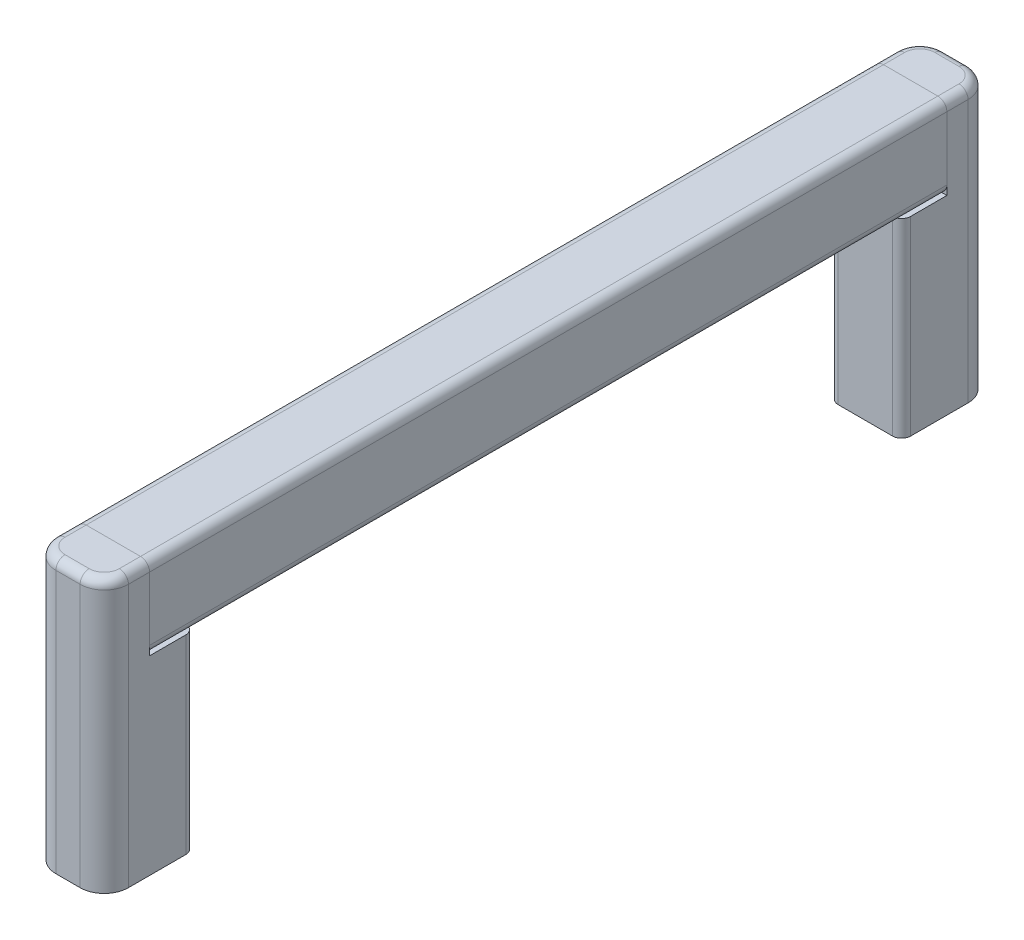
ISO-10303-21;
HEADER;
FILE_DESCRIPTION(('STEP AP214'),'2;1');
FILE_NAME('part.step','',(''),(''),'','','');
FILE_SCHEMA(('AUTOMOTIVE_DESIGN { 1 0 10303 214 1 1 1 1 }'));
ENDSEC;
DATA;
#1=APPLICATION_CONTEXT('core data for automotive mechanical design processes');
#2=APPLICATION_PROTOCOL_DEFINITION('international standard','automotive_design',2000,#1);
#3=PRODUCT_CONTEXT('',#1,'mechanical');
#4=PRODUCT('Part','Part','',(#3));
#5=PRODUCT_RELATED_PRODUCT_CATEGORY('part','',(#4));
#6=PRODUCT_DEFINITION_FORMATION('','',#4);
#7=PRODUCT_DEFINITION_CONTEXT('part definition',#1,'design');
#8=PRODUCT_DEFINITION('design','',#6,#7);
#9=PRODUCT_DEFINITION_SHAPE('','',#8);
#10=(LENGTH_UNIT() NAMED_UNIT(*) SI_UNIT(.MILLI.,.METRE.));
#11=(NAMED_UNIT(*) PLANE_ANGLE_UNIT() SI_UNIT($,.RADIAN.));
#12=(NAMED_UNIT(*) SI_UNIT($,.STERADIAN.) SOLID_ANGLE_UNIT());
#13=UNCERTAINTY_MEASURE_WITH_UNIT(LENGTH_MEASURE(1.E-05),#10,'distance_accuracy_value','');
#14=(GEOMETRIC_REPRESENTATION_CONTEXT(3) GLOBAL_UNCERTAINTY_ASSIGNED_CONTEXT((#13)) GLOBAL_UNIT_ASSIGNED_CONTEXT((#10,
#11,#12)) REPRESENTATION_CONTEXT('',''));
#15=CARTESIAN_POINT('',(0.,0.,0.));
#16=DIRECTION('',(0.,0.,1.));
#17=DIRECTION('',(1.,0.,0.));
#18=AXIS2_PLACEMENT_3D('',#15,#16,#17);
#19=CARTESIAN_POINT('',(-3.,3.50000000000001,44.));
#20=DIRECTION('',(0.,0.,1.));
#21=DIRECTION('',(1.,0.,0.));
#22=AXIS2_PLACEMENT_3D('',#19,#20,#21);
#23=PLANE('',#22);
#24=CARTESIAN_POINT('',(-3.,3.50000000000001,44.));
#25=DIRECTION('',(0.,0.,1.));
#26=DIRECTION('',(1.,0.,0.));
#27=AXIS2_PLACEMENT_3D('',#24,#25,#26);
#28=CIRCLE('',#27,1.);
#29=CARTESIAN_POINT('',(-3.,4.50000000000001,44.));
#30=VERTEX_POINT('',#29);
#31=CARTESIAN_POINT('',(-4.,3.50000000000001,44.));
#32=VERTEX_POINT('',#31);
#33=EDGE_CURVE('P0_E140',#30,#32,#28,.T.);
#34=ORIENTED_EDGE('',*,*,#33,.T.);
#35=DIRECTION('',(0.,-1.,0.));
#36=VECTOR('',#35,1.);
#37=CARTESIAN_POINT('',(-4.,3.50000000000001,44.));
#38=LINE('',#37,#36);
#39=CARTESIAN_POINT('',(-4.,-3.49999999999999,44.));
#40=VERTEX_POINT('',#39);
#41=EDGE_CURVE('P0_E129',#32,#40,#38,.T.);
#42=ORIENTED_EDGE('',*,*,#41,.T.);
#43=CARTESIAN_POINT('',(-3.,-3.49999999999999,44.));
#44=DIRECTION('',(0.,0.,1.));
#45=DIRECTION('',(1.,0.,0.));
#46=AXIS2_PLACEMENT_3D('',#43,#44,#45);
#47=CIRCLE('',#46,1.);
#48=CARTESIAN_POINT('',(-3.,-4.49999999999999,44.));
#49=VERTEX_POINT('',#48);
#50=EDGE_CURVE('P0_E139',#40,#49,#47,.T.);
#51=ORIENTED_EDGE('',*,*,#50,.T.);
#52=DIRECTION('',(1.,0.,0.));
#53=VECTOR('',#52,1.);
#54=CARTESIAN_POINT('',(-3.,-4.49999999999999,44.));
#55=LINE('',#54,#53);
#56=CARTESIAN_POINT('',(3.,-4.49999999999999,44.));
#57=VERTEX_POINT('',#56);
#58=EDGE_CURVE('P0_E224',#49,#57,#55,.T.);
#59=ORIENTED_EDGE('',*,*,#58,.T.);
#60=CARTESIAN_POINT('',(3.,-3.49999999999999,44.));
#61=DIRECTION('',(0.,0.,1.));
#62=DIRECTION('',(1.,0.,0.));
#63=AXIS2_PLACEMENT_3D('',#60,#61,#62);
#64=CIRCLE('',#63,1.);
#65=CARTESIAN_POINT('',(4.,-3.49999999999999,44.));
#66=VERTEX_POINT('',#65);
#67=EDGE_CURVE('P0_E226',#57,#66,#64,.T.);
#68=ORIENTED_EDGE('',*,*,#67,.T.);
#69=DIRECTION('',(0.,1.,0.));
#70=VECTOR('',#69,1.);
#71=CARTESIAN_POINT('',(4.,3.50000000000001,44.));
#72=LINE('',#71,#70);
#73=CARTESIAN_POINT('',(4.,3.50000000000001,44.));
#74=VERTEX_POINT('',#73);
#75=EDGE_CURVE('P0_E228',#66,#74,#72,.T.);
#76=ORIENTED_EDGE('',*,*,#75,.T.);
#77=CARTESIAN_POINT('',(3.,3.50000000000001,44.));
#78=DIRECTION('',(0.,0.,1.));
#79=DIRECTION('',(-1.,0.,0.));
#80=AXIS2_PLACEMENT_3D('',#77,#78,#79);
#81=CIRCLE('',#80,1.);
#82=CARTESIAN_POINT('',(3.,4.50000000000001,44.));
#83=VERTEX_POINT('',#82);
#84=EDGE_CURVE('P0_E230',#74,#83,#81,.T.);
#85=ORIENTED_EDGE('',*,*,#84,.T.);
#86=DIRECTION('',(-1.,0.,0.));
#87=VECTOR('',#86,1.);
#88=CARTESIAN_POINT('',(-3.,4.50000000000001,44.));
#89=LINE('',#88,#87);
#90=EDGE_CURVE('P0_E144',#83,#30,#89,.T.);
#91=ORIENTED_EDGE('',*,*,#90,.T.);
#92=EDGE_LOOP('',(#34,#42,#51,#59,#68,#76,#85,#91));
#93=FACE_BOUND('',#92,.T.);
#94=DIRECTION('',(-1.,0.,0.));
#95=VECTOR('',#94,1.);
#96=CARTESIAN_POINT('',(-1.33333333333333,1.5,44.));
#97=LINE('',#96,#95);
#98=CARTESIAN_POINT('',(0.833333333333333,1.5,44.));
#99=VERTEX_POINT('',#98);
#100=CARTESIAN_POINT('',(-0.833333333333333,1.5,44.));
#101=VERTEX_POINT('',#100);
#102=EDGE_CURVE('P0_E206',#99,#101,#97,.T.);
#103=ORIENTED_EDGE('',*,*,#102,.F.);
#104=CARTESIAN_POINT('',(0.833333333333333,1.,44.));
#105=DIRECTION('',(0.,0.,1.));
#106=DIRECTION('',(1.,0.,0.));
#107=AXIS2_PLACEMENT_3D('',#104,#105,#106);
#108=CIRCLE('',#107,0.5);
#109=CARTESIAN_POINT('',(1.33333333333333,1.,44.));
#110=VERTEX_POINT('',#109);
#111=EDGE_CURVE('P0_E187',#99,#110,#108,.F.);
#112=ORIENTED_EDGE('',*,*,#111,.T.);
#113=DIRECTION('',(0.,1.,0.));
#114=VECTOR('',#113,1.);
#115=CARTESIAN_POINT('',(1.33333333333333,-1.5,44.));
#116=LINE('',#115,#114);
#117=CARTESIAN_POINT('',(1.33333333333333,-0.999999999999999,44.));
#118=VERTEX_POINT('',#117);
#119=EDGE_CURVE('P0_E209',#118,#110,#116,.T.);
#120=ORIENTED_EDGE('',*,*,#119,.F.);
#121=CARTESIAN_POINT('',(0.833333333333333,-0.999999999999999,44.));
#122=DIRECTION('',(0.,0.,1.));
#123=DIRECTION('',(1.,0.,0.));
#124=AXIS2_PLACEMENT_3D('',#121,#122,#123);
#125=CIRCLE('',#124,0.5);
#126=CARTESIAN_POINT('',(0.833333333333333,-1.5,44.));
#127=VERTEX_POINT('',#126);
#128=EDGE_CURVE('P0_E183',#118,#127,#125,.F.);
#129=ORIENTED_EDGE('',*,*,#128,.T.);
#130=DIRECTION('',(1.,0.,0.));
#131=VECTOR('',#130,1.);
#132=CARTESIAN_POINT('',(-1.33333333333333,-1.5,44.));
#133=LINE('',#132,#131);
#134=CARTESIAN_POINT('',(-0.833333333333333,-1.5,44.));
#135=VERTEX_POINT('',#134);
#136=EDGE_CURVE('P0_E211',#135,#127,#133,.T.);
#137=ORIENTED_EDGE('',*,*,#136,.F.);
#138=CARTESIAN_POINT('',(-0.833333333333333,-0.999999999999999,44.));
#139=DIRECTION('',(0.,0.,1.));
#140=DIRECTION('',(1.,0.,0.));
#141=AXIS2_PLACEMENT_3D('',#138,#139,#140);
#142=CIRCLE('',#141,0.5);
#143=CARTESIAN_POINT('',(-1.33333333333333,-0.999999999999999,44.));
#144=VERTEX_POINT('',#143);
#145=EDGE_CURVE('P0_E179',#135,#144,#142,.F.);
#146=ORIENTED_EDGE('',*,*,#145,.T.);
#147=DIRECTION('',(0.,-1.,0.));
#148=VECTOR('',#147,1.);
#149=CARTESIAN_POINT('',(-1.33333333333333,-1.5,44.));
#150=LINE('',#149,#148);
#151=CARTESIAN_POINT('',(-1.33333333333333,1.,44.));
#152=VERTEX_POINT('',#151);
#153=EDGE_CURVE('P0_E208',#152,#144,#150,.T.);
#154=ORIENTED_EDGE('',*,*,#153,.F.);
#155=CARTESIAN_POINT('',(-0.833333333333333,0.999999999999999,44.));
#156=DIRECTION('',(0.,0.,1.));
#157=DIRECTION('',(1.,0.,0.));
#158=AXIS2_PLACEMENT_3D('',#155,#156,#157);
#159=CIRCLE('',#158,0.5);
#160=EDGE_CURVE('P0_E11',#152,#101,#159,.F.);
#161=ORIENTED_EDGE('',*,*,#160,.T.);
#162=EDGE_LOOP('',(#103,#112,#120,#129,#137,#146,#154,#161));
#163=FACE_BOUND('',#162,.T.);
#164=ADVANCED_FACE('P0_F16',(#93,#163),#23,.T.);
#165=CARTESIAN_POINT('',(-3.,3.50000000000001,-44.));
#166=DIRECTION('',(0.,0.,1.));
#167=DIRECTION('',(1.,0.,0.));
#168=AXIS2_PLACEMENT_3D('',#165,#166,#167);
#169=PLANE('',#168);
#170=CARTESIAN_POINT('',(-3.,3.50000000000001,-44.));
#171=DIRECTION('',(0.,0.,1.));
#172=DIRECTION('',(1.,0.,0.));
#173=AXIS2_PLACEMENT_3D('',#170,#171,#172);
#174=CIRCLE('',#173,1.);
#175=CARTESIAN_POINT('',(-3.,4.50000000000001,-44.));
#176=VERTEX_POINT('',#175);
#177=CARTESIAN_POINT('',(-4.,3.50000000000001,-44.));
#178=VERTEX_POINT('',#177);
#179=EDGE_CURVE('P0_E152',#176,#178,#174,.T.);
#180=ORIENTED_EDGE('',*,*,#179,.F.);
#181=DIRECTION('',(-1.,0.,0.));
#182=VECTOR('',#181,1.);
#183=CARTESIAN_POINT('',(-3.,4.50000000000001,-44.));
#184=LINE('',#183,#182);
#185=CARTESIAN_POINT('',(3.,4.50000000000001,-44.));
#186=VERTEX_POINT('',#185);
#187=EDGE_CURVE('P0_E148',#186,#176,#184,.T.);
#188=ORIENTED_EDGE('',*,*,#187,.F.);
#189=CARTESIAN_POINT('',(3.,3.50000000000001,-44.));
#190=DIRECTION('',(0.,0.,1.));
#191=DIRECTION('',(-1.,0.,0.));
#192=AXIS2_PLACEMENT_3D('',#189,#190,#191);
#193=CIRCLE('',#192,1.);
#194=CARTESIAN_POINT('',(4.,3.50000000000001,-44.));
#195=VERTEX_POINT('',#194);
#196=EDGE_CURVE('P0_E245',#195,#186,#193,.T.);
#197=ORIENTED_EDGE('',*,*,#196,.F.);
#198=DIRECTION('',(0.,1.,0.));
#199=VECTOR('',#198,1.);
#200=CARTESIAN_POINT('',(4.,3.50000000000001,-44.));
#201=LINE('',#200,#199);
#202=CARTESIAN_POINT('',(4.,-3.49999999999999,-44.));
#203=VERTEX_POINT('',#202);
#204=EDGE_CURVE('P0_E243',#203,#195,#201,.T.);
#205=ORIENTED_EDGE('',*,*,#204,.F.);
#206=CARTESIAN_POINT('',(3.,-3.49999999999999,-44.));
#207=DIRECTION('',(0.,0.,1.));
#208=DIRECTION('',(1.,0.,0.));
#209=AXIS2_PLACEMENT_3D('',#206,#207,#208);
#210=CIRCLE('',#209,1.);
#211=CARTESIAN_POINT('',(3.,-4.49999999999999,-44.));
#212=VERTEX_POINT('',#211);
#213=EDGE_CURVE('P0_E241',#212,#203,#210,.T.);
#214=ORIENTED_EDGE('',*,*,#213,.F.);
#215=DIRECTION('',(1.,0.,0.));
#216=VECTOR('',#215,1.);
#217=CARTESIAN_POINT('',(-3.,-4.49999999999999,-44.));
#218=LINE('',#217,#216);
#219=CARTESIAN_POINT('',(-3.,-4.49999999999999,-44.));
#220=VERTEX_POINT('',#219);
#221=EDGE_CURVE('P0_E239',#220,#212,#218,.T.);
#222=ORIENTED_EDGE('',*,*,#221,.F.);
#223=CARTESIAN_POINT('',(-3.,-3.49999999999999,-44.));
#224=DIRECTION('',(0.,0.,1.));
#225=DIRECTION('',(1.,0.,0.));
#226=AXIS2_PLACEMENT_3D('',#223,#224,#225);
#227=CIRCLE('',#226,1.);
#228=CARTESIAN_POINT('',(-4.,-3.49999999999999,-44.));
#229=VERTEX_POINT('',#228);
#230=EDGE_CURVE('P0_E237',#229,#220,#227,.T.);
#231=ORIENTED_EDGE('',*,*,#230,.F.);
#232=DIRECTION('',(0.,-1.,0.));
#233=VECTOR('',#232,1.);
#234=CARTESIAN_POINT('',(-4.,3.50000000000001,-44.));
#235=LINE('',#234,#233);
#236=EDGE_CURVE('P0_E235',#178,#229,#235,.T.);
#237=ORIENTED_EDGE('',*,*,#236,.F.);
#238=EDGE_LOOP('',(#180,#188,#197,#205,#214,#222,#231,#237));
#239=FACE_BOUND('',#238,.T.);
#240=DIRECTION('',(1.,0.,0.));
#241=VECTOR('',#240,1.);
#242=CARTESIAN_POINT('',(-1.33333333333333,-1.5,-44.));
#243=LINE('',#242,#241);
#244=CARTESIAN_POINT('',(-0.833333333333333,-1.5,-44.));
#245=VERTEX_POINT('',#244);
#246=CARTESIAN_POINT('',(0.833333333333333,-1.5,-44.));
#247=VERTEX_POINT('',#246);
#248=EDGE_CURVE('P0_E203',#245,#247,#243,.T.);
#249=ORIENTED_EDGE('',*,*,#248,.T.);
#250=CARTESIAN_POINT('',(0.833333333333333,-0.999999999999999,-44.));
#251=DIRECTION('',(0.,0.,1.));
#252=DIRECTION('',(1.,0.,0.));
#253=AXIS2_PLACEMENT_3D('',#250,#251,#252);
#254=CIRCLE('',#253,0.5);
#255=CARTESIAN_POINT('',(1.33333333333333,-0.999999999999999,-44.));
#256=VERTEX_POINT('',#255);
#257=EDGE_CURVE('P0_E181',#247,#256,#254,.T.);
#258=ORIENTED_EDGE('',*,*,#257,.T.);
#259=DIRECTION('',(0.,1.,0.));
#260=VECTOR('',#259,1.);
#261=CARTESIAN_POINT('',(1.33333333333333,-1.5,-44.));
#262=LINE('',#261,#260);
#263=CARTESIAN_POINT('',(1.33333333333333,1.,-44.));
#264=VERTEX_POINT('',#263);
#265=EDGE_CURVE('P0_E218',#256,#264,#262,.T.);
#266=ORIENTED_EDGE('',*,*,#265,.T.);
#267=CARTESIAN_POINT('',(0.833333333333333,1.,-44.));
#268=DIRECTION('',(0.,0.,1.));
#269=DIRECTION('',(1.,0.,0.));
#270=AXIS2_PLACEMENT_3D('',#267,#268,#269);
#271=CIRCLE('',#270,0.5);
#272=CARTESIAN_POINT('',(0.833333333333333,1.5,-44.));
#273=VERTEX_POINT('',#272);
#274=EDGE_CURVE('P0_E185',#264,#273,#271,.T.);
#275=ORIENTED_EDGE('',*,*,#274,.T.);
#276=DIRECTION('',(-1.,0.,0.));
#277=VECTOR('',#276,1.);
#278=CARTESIAN_POINT('',(-1.33333333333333,1.5,-44.));
#279=LINE('',#278,#277);
#280=CARTESIAN_POINT('',(-0.833333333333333,1.5,-44.));
#281=VERTEX_POINT('',#280);
#282=EDGE_CURVE('P0_E195',#273,#281,#279,.T.);
#283=ORIENTED_EDGE('',*,*,#282,.T.);
#284=CARTESIAN_POINT('',(-0.833333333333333,0.999999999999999,-44.));
#285=DIRECTION('',(0.,0.,1.));
#286=DIRECTION('',(1.,0.,0.));
#287=AXIS2_PLACEMENT_3D('',#284,#285,#286);
#288=CIRCLE('',#287,0.5);
#289=CARTESIAN_POINT('',(-1.33333333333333,1.,-44.));
#290=VERTEX_POINT('',#289);
#291=EDGE_CURVE('P0_E24',#281,#290,#288,.T.);
#292=ORIENTED_EDGE('',*,*,#291,.T.);
#293=DIRECTION('',(0.,-1.,0.));
#294=VECTOR('',#293,1.);
#295=CARTESIAN_POINT('',(-1.33333333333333,-1.5,-44.));
#296=LINE('',#295,#294);
#297=CARTESIAN_POINT('',(-1.33333333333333,-0.999999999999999,-44.));
#298=VERTEX_POINT('',#297);
#299=EDGE_CURVE('P0_E194',#290,#298,#296,.T.);
#300=ORIENTED_EDGE('',*,*,#299,.T.);
#301=CARTESIAN_POINT('',(-0.833333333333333,-0.999999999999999,-44.));
#302=DIRECTION('',(0.,0.,1.));
#303=DIRECTION('',(1.,0.,0.));
#304=AXIS2_PLACEMENT_3D('',#301,#302,#303);
#305=CIRCLE('',#304,0.5);
#306=EDGE_CURVE('P0_E177',#298,#245,#305,.T.);
#307=ORIENTED_EDGE('',*,*,#306,.T.);
#308=EDGE_LOOP('',(#249,#258,#266,#275,#283,#292,#300,#307));
#309=FACE_BOUND('',#308,.T.);
#310=ADVANCED_FACE('P0_F193',(#239,#309),#169,.F.);
#311=CARTESIAN_POINT('',(-3.,3.50000000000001,44.));
#312=DIRECTION('',(0.,0.,-1.));
#313=DIRECTION('',(-1.,0.,0.));
#314=AXIS2_PLACEMENT_3D('',#311,#312,#313);
#315=CYLINDRICAL_SURFACE('',#314,1.);
#316=ORIENTED_EDGE('',*,*,#179,.T.);
#317=DIRECTION('',(0.,0.,-1.));
#318=VECTOR('',#317,1.);
#319=CARTESIAN_POINT('',(-4.,3.50000000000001,44.));
#320=LINE('',#319,#318);
#321=EDGE_CURVE('P0_E133',#32,#178,#320,.T.);
#322=ORIENTED_EDGE('',*,*,#321,.F.);
#323=ORIENTED_EDGE('',*,*,#33,.F.);
#324=DIRECTION('',(0.,0.,-1.));
#325=VECTOR('',#324,1.);
#326=CARTESIAN_POINT('',(-3.,4.50000000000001,44.));
#327=LINE('',#326,#325);
#328=EDGE_CURVE('P0_E233',#30,#176,#327,.T.);
#329=ORIENTED_EDGE('',*,*,#328,.T.);
#330=EDGE_LOOP('',(#316,#322,#323,#329));
#331=FACE_BOUND('',#330,.T.);
#332=ADVANCED_FACE('P0_F150',(#331),#315,.T.);
#333=CARTESIAN_POINT('',(-4.,3.50000000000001,44.));
#334=DIRECTION('',(1.,0.,0.));
#335=DIRECTION('',(0.,0.,-1.));
#336=AXIS2_PLACEMENT_3D('',#333,#334,#335);
#337=PLANE('',#336);
#338=ORIENTED_EDGE('',*,*,#236,.T.);
#339=DIRECTION('',(0.,0.,-1.));
#340=VECTOR('',#339,1.);
#341=CARTESIAN_POINT('',(-4.,-3.49999999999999,44.));
#342=LINE('',#341,#340);
#343=EDGE_CURVE('P0_E136',#40,#229,#342,.T.);
#344=ORIENTED_EDGE('',*,*,#343,.F.);
#345=ORIENTED_EDGE('',*,*,#41,.F.);
#346=ORIENTED_EDGE('',*,*,#321,.T.);
#347=EDGE_LOOP('',(#338,#344,#345,#346));
#348=FACE_BOUND('',#347,.T.);
#349=ADVANCED_FACE('P0_F131',(#348),#337,.F.);
#350=CARTESIAN_POINT('',(-3.,-3.49999999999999,44.));
#351=DIRECTION('',(0.,0.,-1.));
#352=DIRECTION('',(-1.,0.,0.));
#353=AXIS2_PLACEMENT_3D('',#350,#351,#352);
#354=CYLINDRICAL_SURFACE('',#353,1.);
#355=ORIENTED_EDGE('',*,*,#230,.T.);
#356=DIRECTION('',(0.,0.,-1.));
#357=VECTOR('',#356,1.);
#358=CARTESIAN_POINT('',(-3.,-4.49999999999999,44.));
#359=LINE('',#358,#357);
#360=EDGE_CURVE('P0_E157',#49,#220,#359,.T.);
#361=ORIENTED_EDGE('',*,*,#360,.F.);
#362=ORIENTED_EDGE('',*,*,#50,.F.);
#363=ORIENTED_EDGE('',*,*,#343,.T.);
#364=EDGE_LOOP('',(#355,#361,#362,#363));
#365=FACE_BOUND('',#364,.T.);
#366=ADVANCED_FACE('P0_F283',(#365),#354,.T.);
#367=CARTESIAN_POINT('',(-3.,-4.49999999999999,44.));
#368=DIRECTION('',(0.,1.,0.));
#369=DIRECTION('',(0.,0.,1.));
#370=AXIS2_PLACEMENT_3D('',#367,#368,#369);
#371=PLANE('',#370);
#372=ORIENTED_EDGE('',*,*,#221,.T.);
#373=DIRECTION('',(0.,0.,-1.));
#374=VECTOR('',#373,1.);
#375=CARTESIAN_POINT('',(3.,-4.49999999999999,44.));
#376=LINE('',#375,#374);
#377=EDGE_CURVE('P0_E258',#57,#212,#376,.T.);
#378=ORIENTED_EDGE('',*,*,#377,.F.);
#379=ORIENTED_EDGE('',*,*,#58,.F.);
#380=ORIENTED_EDGE('',*,*,#360,.T.);
#381=EDGE_LOOP('',(#372,#378,#379,#380));
#382=FACE_BOUND('',#381,.T.);
#383=ADVANCED_FACE('P0_F265',(#382),#371,.F.);
#384=CARTESIAN_POINT('',(3.,-3.49999999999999,44.));
#385=DIRECTION('',(0.,0.,-1.));
#386=DIRECTION('',(-1.,0.,0.));
#387=AXIS2_PLACEMENT_3D('',#384,#385,#386);
#388=CYLINDRICAL_SURFACE('',#387,1.);
#389=ORIENTED_EDGE('',*,*,#213,.T.);
#390=DIRECTION('',(0.,0.,-1.));
#391=VECTOR('',#390,1.);
#392=CARTESIAN_POINT('',(4.,-3.49999999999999,44.));
#393=LINE('',#392,#391);
#394=EDGE_CURVE('P0_E255',#66,#203,#393,.T.);
#395=ORIENTED_EDGE('',*,*,#394,.F.);
#396=ORIENTED_EDGE('',*,*,#67,.F.);
#397=ORIENTED_EDGE('',*,*,#377,.T.);
#398=EDGE_LOOP('',(#389,#395,#396,#397));
#399=FACE_BOUND('',#398,.T.);
#400=ADVANCED_FACE('P0_F275',(#399),#388,.T.);
#401=CARTESIAN_POINT('',(4.,3.50000000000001,44.));
#402=DIRECTION('',(-1.,0.,0.));
#403=DIRECTION('',(0.,0.,1.));
#404=AXIS2_PLACEMENT_3D('',#401,#402,#403);
#405=PLANE('',#404);
#406=ORIENTED_EDGE('',*,*,#204,.T.);
#407=DIRECTION('',(0.,0.,-1.));
#408=VECTOR('',#407,1.);
#409=CARTESIAN_POINT('',(4.,3.50000000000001,44.));
#410=LINE('',#409,#408);
#411=EDGE_CURVE('P0_E252',#74,#195,#410,.T.);
#412=ORIENTED_EDGE('',*,*,#411,.F.);
#413=ORIENTED_EDGE('',*,*,#75,.F.);
#414=ORIENTED_EDGE('',*,*,#394,.T.);
#415=EDGE_LOOP('',(#406,#412,#413,#414));
#416=FACE_BOUND('',#415,.T.);
#417=ADVANCED_FACE('P0_F279',(#416),#405,.F.);
#418=CARTESIAN_POINT('',(3.,3.50000000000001,44.));
#419=DIRECTION('',(0.,0.,-1.));
#420=DIRECTION('',(-1.,0.,0.));
#421=AXIS2_PLACEMENT_3D('',#418,#419,#420);
#422=CYLINDRICAL_SURFACE('',#421,1.);
#423=ORIENTED_EDGE('',*,*,#196,.T.);
#424=DIRECTION('',(0.,0.,-1.));
#425=VECTOR('',#424,1.);
#426=CARTESIAN_POINT('',(3.,4.50000000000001,44.));
#427=LINE('',#426,#425);
#428=EDGE_CURVE('P0_E249',#83,#186,#427,.T.);
#429=ORIENTED_EDGE('',*,*,#428,.F.);
#430=ORIENTED_EDGE('',*,*,#84,.F.);
#431=ORIENTED_EDGE('',*,*,#411,.T.);
#432=EDGE_LOOP('',(#423,#429,#430,#431));
#433=FACE_BOUND('',#432,.T.);
#434=ADVANCED_FACE('P0_F306',(#433),#422,.T.);
#435=CARTESIAN_POINT('',(-3.,4.50000000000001,44.));
#436=DIRECTION('',(0.,-1.,0.));
#437=DIRECTION('',(0.,0.,-1.));
#438=AXIS2_PLACEMENT_3D('',#435,#436,#437);
#439=PLANE('',#438);
#440=ORIENTED_EDGE('',*,*,#187,.T.);
#441=ORIENTED_EDGE('',*,*,#328,.F.);
#442=ORIENTED_EDGE('',*,*,#90,.F.);
#443=ORIENTED_EDGE('',*,*,#428,.T.);
#444=EDGE_LOOP('',(#440,#441,#442,#443));
#445=FACE_BOUND('',#444,.T.);
#446=ADVANCED_FACE('P0_F303',(#445),#439,.F.);
#447=CARTESIAN_POINT('',(1.33333333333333,-1.5,44.));
#448=DIRECTION('',(-1.,0.,0.));
#449=DIRECTION('',(0.,0.,1.));
#450=AXIS2_PLACEMENT_3D('',#447,#448,#449);
#451=PLANE('',#450);
#452=ORIENTED_EDGE('',*,*,#265,.F.);
#453=DIRECTION('',(0.,0.,-1.));
#454=VECTOR('',#453,1.);
#455=CARTESIAN_POINT('',(1.33333333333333,-0.999999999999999,44.));
#456=LINE('',#455,#454);
#457=EDGE_CURVE('P0_E171',#256,#118,#456,.F.);
#458=ORIENTED_EDGE('',*,*,#457,.T.);
#459=ORIENTED_EDGE('',*,*,#119,.T.);
#460=DIRECTION('',(0.,0.,-1.));
#461=VECTOR('',#460,1.);
#462=CARTESIAN_POINT('',(1.33333333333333,1.,-44.));
#463=LINE('',#462,#461);
#464=EDGE_CURVE('P0_E168',#110,#264,#463,.T.);
#465=ORIENTED_EDGE('',*,*,#464,.T.);
#466=EDGE_LOOP('',(#452,#458,#459,#465));
#467=FACE_BOUND('',#466,.T.);
#468=ADVANCED_FACE('P0_F300',(#467),#451,.T.);
#469=CARTESIAN_POINT('',(-1.33333333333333,1.5,44.));
#470=DIRECTION('',(0.,-1.,0.));
#471=DIRECTION('',(1.,0.,0.));
#472=AXIS2_PLACEMENT_3D('',#469,#470,#471);
#473=PLANE('',#472);
#474=ORIENTED_EDGE('',*,*,#282,.F.);
#475=DIRECTION('',(0.,0.,-1.));
#476=VECTOR('',#475,1.);
#477=CARTESIAN_POINT('',(0.833333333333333,1.5,44.));
#478=LINE('',#477,#476);
#479=EDGE_CURVE('P0_E36',#273,#99,#478,.F.);
#480=ORIENTED_EDGE('',*,*,#479,.T.);
#481=ORIENTED_EDGE('',*,*,#102,.T.);
#482=DIRECTION('',(0.,0.,-1.));
#483=VECTOR('',#482,1.);
#484=CARTESIAN_POINT('',(-0.833333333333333,1.5,-44.));
#485=LINE('',#484,#483);
#486=EDGE_CURVE('P0_E173',#101,#281,#485,.T.);
#487=ORIENTED_EDGE('',*,*,#486,.T.);
#488=EDGE_LOOP('',(#474,#480,#481,#487));
#489=FACE_BOUND('',#488,.T.);
#490=ADVANCED_FACE('P0_F205',(#489),#473,.T.);
#491=CARTESIAN_POINT('',(-1.33333333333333,-1.5,44.));
#492=DIRECTION('',(1.,0.,0.));
#493=DIRECTION('',(0.,0.,-1.));
#494=AXIS2_PLACEMENT_3D('',#491,#492,#493);
#495=PLANE('',#494);
#496=ORIENTED_EDGE('',*,*,#153,.T.);
#497=DIRECTION('',(0.,0.,-1.));
#498=VECTOR('',#497,1.);
#499=CARTESIAN_POINT('',(-1.33333333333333,-0.999999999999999,-44.));
#500=LINE('',#499,#498);
#501=EDGE_CURVE('P0_E155',#144,#298,#500,.T.);
#502=ORIENTED_EDGE('',*,*,#501,.T.);
#503=ORIENTED_EDGE('',*,*,#299,.F.);
#504=DIRECTION('',(0.,0.,-1.));
#505=VECTOR('',#504,1.);
#506=CARTESIAN_POINT('',(-1.33333333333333,0.999999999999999,44.));
#507=LINE('',#506,#505);
#508=EDGE_CURVE('P0_E153',#290,#152,#507,.F.);
#509=ORIENTED_EDGE('',*,*,#508,.T.);
#510=EDGE_LOOP('',(#496,#502,#503,#509));
#511=FACE_BOUND('',#510,.T.);
#512=ADVANCED_FACE('P0_F201',(#511),#495,.T.);
#513=CARTESIAN_POINT('',(-1.33333333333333,-1.5,44.));
#514=DIRECTION('',(0.,1.,0.));
#515=DIRECTION('',(0.,0.,1.));
#516=AXIS2_PLACEMENT_3D('',#513,#514,#515);
#517=PLANE('',#516);
#518=ORIENTED_EDGE('',*,*,#248,.F.);
#519=DIRECTION('',(0.,0.,-1.));
#520=VECTOR('',#519,1.);
#521=CARTESIAN_POINT('',(-0.833333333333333,-1.5,44.));
#522=LINE('',#521,#520);
#523=EDGE_CURVE('P0_E166',#245,#135,#522,.F.);
#524=ORIENTED_EDGE('',*,*,#523,.T.);
#525=ORIENTED_EDGE('',*,*,#136,.T.);
#526=DIRECTION('',(0.,0.,-1.));
#527=VECTOR('',#526,1.);
#528=CARTESIAN_POINT('',(0.833333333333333,-1.5,-44.));
#529=LINE('',#528,#527);
#530=EDGE_CURVE('P0_E163',#127,#247,#529,.T.);
#531=ORIENTED_EDGE('',*,*,#530,.T.);
#532=EDGE_LOOP('',(#518,#524,#525,#531));
#533=FACE_BOUND('',#532,.T.);
#534=ADVANCED_FACE('P0_F355',(#533),#517,.T.);
#535=CARTESIAN_POINT('',(-0.833333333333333,-0.999999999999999,44.));
#536=DIRECTION('',(0.,0.,1.));
#537=DIRECTION('',(1.,0.,0.));
#538=AXIS2_PLACEMENT_3D('',#535,#536,#537);
#539=CYLINDRICAL_SURFACE('',#538,0.5);
#540=ORIENTED_EDGE('',*,*,#145,.F.);
#541=ORIENTED_EDGE('',*,*,#523,.F.);
#542=ORIENTED_EDGE('',*,*,#306,.F.);
#543=ORIENTED_EDGE('',*,*,#501,.F.);
#544=EDGE_LOOP('',(#540,#541,#542,#543));
#545=FACE_BOUND('',#544,.T.);
#546=ADVANCED_FACE('P0_F363',(#545),#539,.F.);
#547=CARTESIAN_POINT('',(0.833333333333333,-0.999999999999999,44.));
#548=DIRECTION('',(0.,0.,1.));
#549=DIRECTION('',(1.,0.,0.));
#550=AXIS2_PLACEMENT_3D('',#547,#548,#549);
#551=CYLINDRICAL_SURFACE('',#550,0.5);
#552=ORIENTED_EDGE('',*,*,#128,.F.);
#553=ORIENTED_EDGE('',*,*,#457,.F.);
#554=ORIENTED_EDGE('',*,*,#257,.F.);
#555=ORIENTED_EDGE('',*,*,#530,.F.);
#556=EDGE_LOOP('',(#552,#553,#554,#555));
#557=FACE_BOUND('',#556,.T.);
#558=ADVANCED_FACE('P0_F372',(#557),#551,.F.);
#559=CARTESIAN_POINT('',(0.833333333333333,1.,44.));
#560=DIRECTION('',(0.,0.,1.));
#561=DIRECTION('',(1.,0.,0.));
#562=AXIS2_PLACEMENT_3D('',#559,#560,#561);
#563=CYLINDRICAL_SURFACE('',#562,0.5);
#564=ORIENTED_EDGE('',*,*,#111,.F.);
#565=ORIENTED_EDGE('',*,*,#479,.F.);
#566=ORIENTED_EDGE('',*,*,#274,.F.);
#567=ORIENTED_EDGE('',*,*,#464,.F.);
#568=EDGE_LOOP('',(#564,#565,#566,#567));
#569=FACE_BOUND('',#568,.T.);
#570=ADVANCED_FACE('P0_F381',(#569),#563,.F.);
#571=CARTESIAN_POINT('',(-0.833333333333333,0.999999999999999,44.));
#572=DIRECTION('',(0.,0.,1.));
#573=DIRECTION('',(1.,0.,0.));
#574=AXIS2_PLACEMENT_3D('',#571,#572,#573);
#575=CYLINDRICAL_SURFACE('',#574,0.5);
#576=ORIENTED_EDGE('',*,*,#160,.F.);
#577=ORIENTED_EDGE('',*,*,#508,.F.);
#578=ORIENTED_EDGE('',*,*,#291,.F.);
#579=ORIENTED_EDGE('',*,*,#486,.F.);
#580=EDGE_LOOP('',(#576,#577,#578,#579));
#581=FACE_BOUND('',#580,.T.);
#582=ADVANCED_FACE('P0_F18',(#581),#575,.F.);
#583=CLOSED_SHELL('',(#164,#310,#332,#349,#366,#383,#400,#417,#434,#446,#468,#490,#512,#534,
#546,#558,#570,#582));
#584=MANIFOLD_SOLID_BREP('P0_B1',#583);
#585=CARTESIAN_POINT('',(0.,-25.5,-44.));
#586=DIRECTION('',(0.,1.,0.));
#587=DIRECTION('',(-1.,0.,0.));
#588=AXIS2_PLACEMENT_3D('',#585,#586,#587);
#589=CYLINDRICAL_SURFACE('',#588,3.24999999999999);
#590=CARTESIAN_POINT('',(0.,-11.2769088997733,-44.));
#591=DIRECTION('',(0.,1.,0.));
#592=DIRECTION('',(-1.,0.,0.));
#593=AXIS2_PLACEMENT_3D('',#590,#591,#592);
#594=CIRCLE('',#593,3.24999999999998);
#595=CARTESIAN_POINT('',(-3.24999999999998,-11.2769088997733,-44.));
#596=VERTEX_POINT('',#595);
#597=EDGE_CURVE('P1_E11',#596,#596,#594,.T.);
#598=ORIENTED_EDGE('',*,*,#597,.F.);
#599=EDGE_LOOP('',(#598));
#600=FACE_BOUND('',#599,.T.);
#601=CARTESIAN_POINT('',(0.,-25.5,-44.));
#602=DIRECTION('',(0.,1.,0.));
#603=DIRECTION('',(-1.,0.,0.));
#604=AXIS2_PLACEMENT_3D('',#601,#602,#603);
#605=CIRCLE('',#604,3.25);
#606=CARTESIAN_POINT('',(-3.25,-25.5,-44.));
#607=VERTEX_POINT('',#606);
#608=EDGE_CURVE('P1_E51',#607,#607,#605,.T.);
#609=ORIENTED_EDGE('',*,*,#608,.T.);
#610=EDGE_LOOP('',(#609));
#611=FACE_BOUND('',#610,.T.);
#612=ADVANCED_FACE('P1_F16',(#600,#611),#589,.T.);
#613=CARTESIAN_POINT('',(0.,-11.2769088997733,-44.));
#614=DIRECTION('',(0.,1.,0.));
#615=DIRECTION('',(-1.,0.,0.));
#616=AXIS2_PLACEMENT_3D('',#613,#614,#615);
#617=TOROIDAL_SURFACE('',#616,2.25,0.999999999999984);
#618=CARTESIAN_POINT('',(0.,-10.2807142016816,-44.));
#619=DIRECTION('',(0.,1.,0.));
#620=DIRECTION('',(-1.,0.,0.));
#621=AXIS2_PLACEMENT_3D('',#618,#619,#620);
#622=CIRCLE('',#621,2.33715574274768);
#623=CARTESIAN_POINT('',(-2.33715574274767,-10.2807142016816,-44.));
#624=VERTEX_POINT('',#623);
#625=EDGE_CURVE('P1_E23',#624,#624,#622,.T.);
#626=ORIENTED_EDGE('',*,*,#625,.F.);
#627=EDGE_LOOP('',(#626));
#628=FACE_BOUND('',#627,.T.);
#629=ORIENTED_EDGE('',*,*,#597,.T.);
#630=EDGE_LOOP('',(#629));
#631=FACE_BOUND('',#630,.T.);
#632=ADVANCED_FACE('P1_F33',(#628,#631),#617,.T.);
#633=CARTESIAN_POINT('',(0.,-10.2807142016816,-44.));
#634=DIRECTION('',(0.,-1.,0.));
#635=DIRECTION('',(1.,0.,0.));
#636=AXIS2_PLACEMENT_3D('',#633,#634,#635);
#637=CONICAL_SURFACE('',#636,2.33715574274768,1.48352986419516);
#638=CARTESIAN_POINT('',(0.,-10.0762395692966,-44.));
#639=VERTEX_POINT('',#638);
#640=VERTEX_LOOP('',#639);
#641=FACE_BOUND('',#640,.T.);
#642=ORIENTED_EDGE('',*,*,#625,.T.);
#643=EDGE_LOOP('',(#642));
#644=FACE_BOUND('',#643,.T.);
#645=ADVANCED_FACE('P1_F29',(#641,#644),#637,.T.);
#646=CARTESIAN_POINT('',(0.,-13.5762395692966,-44.));
#647=DIRECTION('',(0.,-1.,0.));
#648=DIRECTION('',(1.,0.,0.));
#649=AXIS2_PLACEMENT_3D('',#646,#647,#648);
#650=CONICAL_SURFACE('',#649,0.,1.04719755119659);
#651=CARTESIAN_POINT('',(0.,-14.5,-44.));
#652=DIRECTION('',(0.,1.,0.));
#653=DIRECTION('',(-1.,0.,0.));
#654=AXIS2_PLACEMENT_3D('',#651,#652,#653);
#655=CIRCLE('',#654,1.6);
#656=CARTESIAN_POINT('',(-1.6,-14.5,-44.));
#657=VERTEX_POINT('',#656);
#658=EDGE_CURVE('P1_E38',#657,#657,#655,.T.);
#659=ORIENTED_EDGE('',*,*,#658,.F.);
#660=EDGE_LOOP('',(#659));
#661=FACE_BOUND('',#660,.T.);
#662=CARTESIAN_POINT('',(0.,-13.5762395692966,-44.));
#663=VERTEX_POINT('',#662);
#664=VERTEX_LOOP('',#663);
#665=FACE_BOUND('',#664,.T.);
#666=ADVANCED_FACE('P1_F32',(#661,#665),#650,.F.);
#667=CARTESIAN_POINT('',(0.,-25.5,-44.));
#668=DIRECTION('',(0.,1.,0.));
#669=DIRECTION('',(-1.,0.,0.));
#670=AXIS2_PLACEMENT_3D('',#667,#668,#669);
#671=CYLINDRICAL_SURFACE('',#670,1.6);
#672=CARTESIAN_POINT('',(0.,-17.5,-44.));
#673=DIRECTION('',(0.,1.,0.));
#674=DIRECTION('',(-1.,0.,0.));
#675=AXIS2_PLACEMENT_3D('',#672,#673,#674);
#676=CIRCLE('',#675,1.6);
#677=CARTESIAN_POINT('',(-1.6,-17.5,-44.));
#678=VERTEX_POINT('',#677);
#679=EDGE_CURVE('P1_E40',#678,#678,#676,.T.);
#680=ORIENTED_EDGE('',*,*,#679,.F.);
#681=EDGE_LOOP('',(#680));
#682=FACE_BOUND('',#681,.T.);
#683=ORIENTED_EDGE('',*,*,#658,.T.);
#684=EDGE_LOOP('',(#683));
#685=FACE_BOUND('',#684,.T.);
#686=ADVANCED_FACE('P1_F71',(#682,#685),#671,.F.);
#687=CARTESIAN_POINT('',(0.,-17.5,-42.));
#688=DIRECTION('',(0.,1.,0.));
#689=DIRECTION('',(-1.,0.,0.));
#690=AXIS2_PLACEMENT_3D('',#687,#688,#689);
#691=PLANE('',#690);
#692=CARTESIAN_POINT('',(0.,-17.5,-44.));
#693=DIRECTION('',(0.,1.,0.));
#694=DIRECTION('',(-1.,0.,0.));
#695=AXIS2_PLACEMENT_3D('',#692,#693,#694);
#696=CIRCLE('',#695,2.);
#697=CARTESIAN_POINT('',(-2.,-17.5,-44.));
#698=VERTEX_POINT('',#697);
#699=EDGE_CURVE('P1_E45',#698,#698,#696,.T.);
#700=ORIENTED_EDGE('',*,*,#699,.F.);
#701=EDGE_LOOP('',(#700));
#702=FACE_BOUND('',#701,.T.);
#703=ORIENTED_EDGE('',*,*,#679,.T.);
#704=EDGE_LOOP('',(#703));
#705=FACE_BOUND('',#704,.T.);
#706=ADVANCED_FACE('P1_F65',(#702,#705),#691,.F.);
#707=CARTESIAN_POINT('',(0.,-25.5,-44.));
#708=DIRECTION('',(0.,1.,0.));
#709=DIRECTION('',(-1.,0.,0.));
#710=AXIS2_PLACEMENT_3D('',#707,#708,#709);
#711=CYLINDRICAL_SURFACE('',#710,2.);
#712=CARTESIAN_POINT('',(0.,-25.5,-44.));
#713=DIRECTION('',(0.,1.,0.));
#714=DIRECTION('',(-1.,0.,0.));
#715=AXIS2_PLACEMENT_3D('',#712,#713,#714);
#716=CIRCLE('',#715,2.);
#717=CARTESIAN_POINT('',(-2.,-25.5,-44.));
#718=VERTEX_POINT('',#717);
#719=EDGE_CURVE('P1_E48',#718,#718,#716,.T.);
#720=ORIENTED_EDGE('',*,*,#719,.F.);
#721=EDGE_LOOP('',(#720));
#722=FACE_BOUND('',#721,.T.);
#723=ORIENTED_EDGE('',*,*,#699,.T.);
#724=EDGE_LOOP('',(#723));
#725=FACE_BOUND('',#724,.T.);
#726=ADVANCED_FACE('P1_F59',(#722,#725),#711,.F.);
#727=CARTESIAN_POINT('',(0.,-25.5,-42.));
#728=DIRECTION('',(0.,1.,0.));
#729=DIRECTION('',(-1.,0.,0.));
#730=AXIS2_PLACEMENT_3D('',#727,#728,#729);
#731=PLANE('',#730);
#732=ORIENTED_EDGE('',*,*,#608,.F.);
#733=EDGE_LOOP('',(#732));
#734=FACE_BOUND('',#733,.T.);
#735=ORIENTED_EDGE('',*,*,#719,.T.);
#736=EDGE_LOOP('',(#735));
#737=FACE_BOUND('',#736,.T.);
#738=ADVANCED_FACE('P1_F56',(#734,#737),#731,.F.);
#739=CLOSED_SHELL('',(#612,#632,#645,#666,#686,#706,#726,#738));
#740=MANIFOLD_SOLID_BREP('P1_B1',#739);
#741=CARTESIAN_POINT('',(-1.33333333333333,-25.5,-46.3333333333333));
#742=DIRECTION('',(0.,1.,0.));
#743=DIRECTION('',(-1.,0.,0.));
#744=AXIS2_PLACEMENT_3D('',#741,#742,#743);
#745=PLANE('',#744);
#746=DIRECTION('',(0.,0.,-1.));
#747=VECTOR('',#746,1.);
#748=CARTESIAN_POINT('',(4.,-25.5,-46.3333333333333));
#749=LINE('',#748,#747);
#750=CARTESIAN_POINT('',(4.,-25.5,-40.));
#751=VERTEX_POINT('',#750);
#752=CARTESIAN_POINT('',(4.,-25.5,-46.3333333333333));
#753=VERTEX_POINT('',#752);
#754=EDGE_CURVE('P2_E225',#751,#753,#749,.T.);
#755=ORIENTED_EDGE('',*,*,#754,.F.);
#756=CARTESIAN_POINT('',(3.,-25.5,-40.));
#757=DIRECTION('',(0.,1.,0.));
#758=DIRECTION('',(-1.,0.,0.));
#759=AXIS2_PLACEMENT_3D('',#756,#757,#758);
#760=CIRCLE('',#759,1.);
#761=CARTESIAN_POINT('',(3.,-25.5,-39.));
#762=VERTEX_POINT('',#761);
#763=EDGE_CURVE('P2_E276',#751,#762,#760,.F.);
#764=ORIENTED_EDGE('',*,*,#763,.T.);
#765=DIRECTION('',(1.,0.,0.));
#766=VECTOR('',#765,1.);
#767=CARTESIAN_POINT('',(4.,-25.5,-39.));
#768=LINE('',#767,#766);
#769=CARTESIAN_POINT('',(-3.,-25.5,-39.));
#770=VERTEX_POINT('',#769);
#771=EDGE_CURVE('P2_E220',#770,#762,#768,.T.);
#772=ORIENTED_EDGE('',*,*,#771,.F.);
#773=CARTESIAN_POINT('',(-3.,-25.5,-40.));
#774=DIRECTION('',(0.,1.,0.));
#775=DIRECTION('',(-1.,0.,0.));
#776=AXIS2_PLACEMENT_3D('',#773,#774,#775);
#777=CIRCLE('',#776,1.);
#778=CARTESIAN_POINT('',(-4.,-25.5,-40.));
#779=VERTEX_POINT('',#778);
#780=EDGE_CURVE('P2_E274',#770,#779,#777,.F.);
#781=ORIENTED_EDGE('',*,*,#780,.T.);
#782=DIRECTION('',(0.,0.,1.));
#783=VECTOR('',#782,1.);
#784=CARTESIAN_POINT('',(-4.,-25.5,-46.3333333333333));
#785=LINE('',#784,#783);
#786=CARTESIAN_POINT('',(-4.,-25.5,-46.3333333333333));
#787=VERTEX_POINT('',#786);
#788=EDGE_CURVE('P2_E237',#787,#779,#785,.T.);
#789=ORIENTED_EDGE('',*,*,#788,.F.);
#790=CARTESIAN_POINT('',(-1.33333333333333,-25.5,-46.3333333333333));
#791=DIRECTION('',(0.,1.,0.));
#792=DIRECTION('',(-1.,0.,0.));
#793=AXIS2_PLACEMENT_3D('',#790,#791,#792);
#794=CIRCLE('',#793,2.66666666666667);
#795=CARTESIAN_POINT('',(-1.33333333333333,-25.5,-49.));
#796=VERTEX_POINT('',#795);
#797=EDGE_CURVE('P2_E234',#796,#787,#794,.T.);
#798=ORIENTED_EDGE('',*,*,#797,.F.);
#799=DIRECTION('',(-1.,0.,0.));
#800=VECTOR('',#799,1.);
#801=CARTESIAN_POINT('',(1.33333333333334,-25.5,-49.));
#802=LINE('',#801,#800);
#803=CARTESIAN_POINT('',(1.33333333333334,-25.5,-49.));
#804=VERTEX_POINT('',#803);
#805=EDGE_CURVE('P2_E231',#804,#796,#802,.T.);
#806=ORIENTED_EDGE('',*,*,#805,.F.);
#807=CARTESIAN_POINT('',(1.33333333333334,-25.5,-46.3333333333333));
#808=DIRECTION('',(0.,1.,0.));
#809=DIRECTION('',(-1.,0.,0.));
#810=AXIS2_PLACEMENT_3D('',#807,#808,#809);
#811=CIRCLE('',#810,2.66666666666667);
#812=EDGE_CURVE('P2_E228',#753,#804,#811,.T.);
#813=ORIENTED_EDGE('',*,*,#812,.F.);
#814=EDGE_LOOP('',(#755,#764,#772,#781,#789,#798,#806,#813));
#815=FACE_BOUND('',#814,.T.);
#816=CARTESIAN_POINT('',(0.,-25.5,-44.));
#817=DIRECTION('',(0.,1.,0.));
#818=DIRECTION('',(0.,0.,-1.));
#819=AXIS2_PLACEMENT_3D('',#816,#817,#818);
#820=CIRCLE('',#819,3.25);
#821=CARTESIAN_POINT('',(0.,-25.5,-47.25));
#822=VERTEX_POINT('',#821);
#823=EDGE_CURVE('P2_E172',#822,#822,#820,.T.);
#824=ORIENTED_EDGE('',*,*,#823,.T.);
#825=EDGE_LOOP('',(#824));
#826=FACE_BOUND('',#825,.T.);
#827=ADVANCED_FACE('P2_F16',(#815,#826),#745,.F.);
#828=CARTESIAN_POINT('',(4.,-4.5,-44.));
#829=DIRECTION('',(0.,0.,-1.));
#830=DIRECTION('',(-1.,0.,0.));
#831=AXIS2_PLACEMENT_3D('',#828,#829,#830);
#832=PLANE('',#831);
#833=DIRECTION('',(0.,1.,0.));
#834=VECTOR('',#833,1.);
#835=CARTESIAN_POINT('',(4.,-4.5,-44.));
#836=LINE('',#835,#834);
#837=CARTESIAN_POINT('',(4.,-4.5,-44.));
#838=VERTEX_POINT('',#837);
#839=CARTESIAN_POINT('',(4.,3.5,-44.));
#840=VERTEX_POINT('',#839);
#841=EDGE_CURVE('P2_E217',#838,#840,#836,.T.);
#842=ORIENTED_EDGE('',*,*,#841,.T.);
#843=CARTESIAN_POINT('',(3.,3.5,-44.));
#844=DIRECTION('',(0.,0.,-1.));
#845=DIRECTION('',(-1.,0.,0.));
#846=AXIS2_PLACEMENT_3D('',#843,#844,#845);
#847=CIRCLE('',#846,1.);
#848=CARTESIAN_POINT('',(3.,4.5,-44.));
#849=VERTEX_POINT('',#848);
#850=EDGE_CURVE('P2_E266',#840,#849,#847,.F.);
#851=ORIENTED_EDGE('',*,*,#850,.T.);
#852=DIRECTION('',(-1.,0.,0.));
#853=VECTOR('',#852,1.);
#854=CARTESIAN_POINT('',(4.,4.5,-44.));
#855=LINE('',#854,#853);
#856=CARTESIAN_POINT('',(-3.,4.5,-44.));
#857=VERTEX_POINT('',#856);
#858=EDGE_CURVE('P2_E191',#849,#857,#855,.T.);
#859=ORIENTED_EDGE('',*,*,#858,.T.);
#860=CARTESIAN_POINT('',(-3.,3.5,-44.));
#861=DIRECTION('',(0.,0.,-1.));
#862=DIRECTION('',(-1.,0.,0.));
#863=AXIS2_PLACEMENT_3D('',#860,#861,#862);
#864=CIRCLE('',#863,1.);
#865=CARTESIAN_POINT('',(-4.,3.5,-44.));
#866=VERTEX_POINT('',#865);
#867=EDGE_CURVE('P2_E264',#857,#866,#864,.F.);
#868=ORIENTED_EDGE('',*,*,#867,.T.);
#869=DIRECTION('',(0.,1.,0.));
#870=VECTOR('',#869,1.);
#871=CARTESIAN_POINT('',(-4.,-4.5,-44.));
#872=LINE('',#871,#870);
#873=CARTESIAN_POINT('',(-4.,-4.5,-44.));
#874=VERTEX_POINT('',#873);
#875=EDGE_CURVE('P2_E214',#874,#866,#872,.T.);
#876=ORIENTED_EDGE('',*,*,#875,.F.);
#877=DIRECTION('',(-1.,0.,0.));
#878=VECTOR('',#877,1.);
#879=CARTESIAN_POINT('',(4.,-4.5,-44.));
#880=LINE('',#879,#878);
#881=EDGE_CURVE('P2_E203',#838,#874,#880,.T.);
#882=ORIENTED_EDGE('',*,*,#881,.F.);
#883=EDGE_LOOP('',(#842,#851,#859,#868,#876,#882));
#884=FACE_BOUND('',#883,.T.);
#885=DIRECTION('',(0.,-1.,0.));
#886=VECTOR('',#885,1.);
#887=CARTESIAN_POINT('',(-1.33333333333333,1.5,-44.));
#888=LINE('',#887,#886);
#889=CARTESIAN_POINT('',(-1.33333333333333,0.999999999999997,-44.));
#890=VERTEX_POINT('',#889);
#891=CARTESIAN_POINT('',(-1.33333333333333,-1.,-44.));
#892=VERTEX_POINT('',#891);
#893=EDGE_CURVE('P2_E192',#890,#892,#888,.T.);
#894=ORIENTED_EDGE('',*,*,#893,.F.);
#895=CARTESIAN_POINT('',(-0.83333333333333,0.999999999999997,-44.));
#896=DIRECTION('',(0.,0.,-1.));
#897=DIRECTION('',(-1.,0.,0.));
#898=AXIS2_PLACEMENT_3D('',#895,#896,#897);
#899=CIRCLE('',#898,0.5);
#900=CARTESIAN_POINT('',(-0.83333333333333,1.5,-44.));
#901=VERTEX_POINT('',#900);
#902=EDGE_CURVE('P2_E11',#890,#901,#899,.T.);
#903=ORIENTED_EDGE('',*,*,#902,.T.);
#904=DIRECTION('',(-1.,0.,0.));
#905=VECTOR('',#904,1.);
#906=CARTESIAN_POINT('',(-1.33333333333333,1.5,-44.));
#907=LINE('',#906,#905);
#908=CARTESIAN_POINT('',(0.833333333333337,1.5,-44.));
#909=VERTEX_POINT('',#908);
#910=EDGE_CURVE('P2_E182',#909,#901,#907,.T.);
#911=ORIENTED_EDGE('',*,*,#910,.F.);
#912=CARTESIAN_POINT('',(0.833333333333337,0.999999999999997,-44.));
#913=DIRECTION('',(0.,0.,-1.));
#914=DIRECTION('',(-1.,0.,0.));
#915=AXIS2_PLACEMENT_3D('',#912,#913,#914);
#916=CIRCLE('',#915,0.5);
#917=CARTESIAN_POINT('',(1.33333333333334,0.999999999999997,-44.));
#918=VERTEX_POINT('',#917);
#919=EDGE_CURVE('P2_E329',#909,#918,#916,.T.);
#920=ORIENTED_EDGE('',*,*,#919,.T.);
#921=DIRECTION('',(0.,1.,0.));
#922=VECTOR('',#921,1.);
#923=CARTESIAN_POINT('',(1.33333333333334,1.5,-44.));
#924=LINE('',#923,#922);
#925=CARTESIAN_POINT('',(1.33333333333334,-1.,-44.));
#926=VERTEX_POINT('',#925);
#927=EDGE_CURVE('P2_E198',#926,#918,#924,.T.);
#928=ORIENTED_EDGE('',*,*,#927,.F.);
#929=CARTESIAN_POINT('',(0.833333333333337,-1.,-44.));
#930=DIRECTION('',(0.,0.,-1.));
#931=DIRECTION('',(-1.,0.,0.));
#932=AXIS2_PLACEMENT_3D('',#929,#930,#931);
#933=CIRCLE('',#932,0.5);
#934=CARTESIAN_POINT('',(0.833333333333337,-1.5,-44.));
#935=VERTEX_POINT('',#934);
#936=EDGE_CURVE('P2_E327',#926,#935,#933,.T.);
#937=ORIENTED_EDGE('',*,*,#936,.T.);
#938=DIRECTION('',(1.,0.,0.));
#939=VECTOR('',#938,1.);
#940=CARTESIAN_POINT('',(-1.33333333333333,-1.5,-44.));
#941=LINE('',#940,#939);
#942=CARTESIAN_POINT('',(-0.83333333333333,-1.5,-44.));
#943=VERTEX_POINT('',#942);
#944=EDGE_CURVE('P2_E194',#943,#935,#941,.T.);
#945=ORIENTED_EDGE('',*,*,#944,.F.);
#946=CARTESIAN_POINT('',(-0.83333333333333,-1.,-44.));
#947=DIRECTION('',(0.,0.,-1.));
#948=DIRECTION('',(-1.,0.,0.));
#949=AXIS2_PLACEMENT_3D('',#946,#947,#948);
#950=CIRCLE('',#949,0.5);
#951=EDGE_CURVE('P2_E24',#943,#892,#950,.T.);
#952=ORIENTED_EDGE('',*,*,#951,.T.);
#953=EDGE_LOOP('',(#894,#903,#911,#920,#928,#937,#945,#952));
#954=FACE_BOUND('',#953,.T.);
#955=ADVANCED_FACE('P2_F332',(#884,#954),#832,.F.);
#956=CARTESIAN_POINT('',(4.,4.5,-39.));
#957=DIRECTION('',(0.,0.,-1.));
#958=DIRECTION('',(-1.,0.,0.));
#959=AXIS2_PLACEMENT_3D('',#956,#957,#958);
#960=PLANE('',#959);
#961=ORIENTED_EDGE('',*,*,#771,.T.);
#962=DIRECTION('',(0.,-1.,0.));
#963=VECTOR('',#962,1.);
#964=CARTESIAN_POINT('',(3.,4.5,-39.));
#965=LINE('',#964,#963);
#966=CARTESIAN_POINT('',(3.,-4.5,-39.));
#967=VERTEX_POINT('',#966);
#968=EDGE_CURVE('P2_E281',#762,#967,#965,.F.);
#969=ORIENTED_EDGE('',*,*,#968,.T.);
#970=DIRECTION('',(1.,0.,0.));
#971=VECTOR('',#970,1.);
#972=CARTESIAN_POINT('',(4.,-4.5,-39.));
#973=LINE('',#972,#971);
#974=CARTESIAN_POINT('',(-3.,-4.5,-39.));
#975=VERTEX_POINT('',#974);
#976=EDGE_CURVE('P2_E209',#975,#967,#973,.T.);
#977=ORIENTED_EDGE('',*,*,#976,.F.);
#978=DIRECTION('',(0.,-1.,0.));
#979=VECTOR('',#978,1.);
#980=CARTESIAN_POINT('',(-3.,4.5,-39.));
#981=LINE('',#980,#979);
#982=EDGE_CURVE('P2_E278',#975,#770,#981,.T.);
#983=ORIENTED_EDGE('',*,*,#982,.T.);
#984=EDGE_LOOP('',(#961,#969,#977,#983));
#985=FACE_BOUND('',#984,.T.);
#986=ADVANCED_FACE('P2_F376',(#985),#960,.F.);
#987=CARTESIAN_POINT('',(4.,4.5,-46.3333333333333));
#988=DIRECTION('',(-1.,0.,0.));
#989=DIRECTION('',(0.,0.,1.));
#990=AXIS2_PLACEMENT_3D('',#987,#988,#989);
#991=PLANE('',#990);
#992=DIRECTION('',(0.,-1.,0.));
#993=VECTOR('',#992,1.);
#994=CARTESIAN_POINT('',(4.,4.5,-46.3333333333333));
#995=LINE('',#994,#993);
#996=CARTESIAN_POINT('',(4.,3.5,-46.3333333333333));
#997=VERTEX_POINT('',#996);
#998=EDGE_CURVE('P2_E246',#997,#753,#995,.T.);
#999=ORIENTED_EDGE('',*,*,#998,.F.);
#1000=DIRECTION('',(0.,0.,-1.));
#1001=VECTOR('',#1000,1.);
#1002=CARTESIAN_POINT('',(4.,3.5,-44.));
#1003=LINE('',#1002,#1001);
#1004=EDGE_CURVE('P2_E262',#997,#840,#1003,.F.);
#1005=ORIENTED_EDGE('',*,*,#1004,.T.);
#1006=ORIENTED_EDGE('',*,*,#841,.F.);
#1007=DIRECTION('',(0.,0.,-1.));
#1008=VECTOR('',#1007,1.);
#1009=CARTESIAN_POINT('',(4.,-4.5,-44.));
#1010=LINE('',#1009,#1008);
#1011=CARTESIAN_POINT('',(4.,-4.5,-40.));
#1012=VERTEX_POINT('',#1011);
#1013=EDGE_CURVE('P2_E212',#1012,#838,#1010,.T.);
#1014=ORIENTED_EDGE('',*,*,#1013,.F.);
#1015=DIRECTION('',(0.,-1.,0.));
#1016=VECTOR('',#1015,1.);
#1017=CARTESIAN_POINT('',(4.,4.5,-40.));
#1018=LINE('',#1017,#1016);
#1019=EDGE_CURVE('P2_E259',#1012,#751,#1018,.T.);
#1020=ORIENTED_EDGE('',*,*,#1019,.T.);
#1021=ORIENTED_EDGE('',*,*,#754,.T.);
#1022=EDGE_LOOP('',(#999,#1005,#1006,#1014,#1020,#1021));
#1023=FACE_BOUND('',#1022,.T.);
#1024=ADVANCED_FACE('P2_F399',(#1023),#991,.F.);
#1025=CARTESIAN_POINT('',(1.33333333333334,4.5,-46.3333333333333));
#1026=DIRECTION('',(0.,-1.,0.));
#1027=DIRECTION('',(1.,0.,0.));
#1028=AXIS2_PLACEMENT_3D('',#1025,#1026,#1027);
#1029=CYLINDRICAL_SURFACE('',#1028,2.66666666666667);
#1030=DIRECTION('',(0.,-1.,0.));
#1031=VECTOR('',#1030,1.);
#1032=CARTESIAN_POINT('',(1.33333333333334,4.5,-49.));
#1033=LINE('',#1032,#1031);
#1034=CARTESIAN_POINT('',(1.33333333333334,3.5,-49.));
#1035=VERTEX_POINT('',#1034);
#1036=EDGE_CURVE('P2_E244',#1035,#804,#1033,.T.);
#1037=ORIENTED_EDGE('',*,*,#1036,.F.);
#1038=CARTESIAN_POINT('',(1.33333333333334,3.5,-46.3333333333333));
#1039=DIRECTION('',(0.,1.,0.));
#1040=DIRECTION('',(-1.,0.,0.));
#1041=AXIS2_PLACEMENT_3D('',#1038,#1039,#1040);
#1042=CIRCLE('',#1041,2.66666666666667);
#1043=EDGE_CURVE('P2_E268',#1035,#997,#1042,.F.);
#1044=ORIENTED_EDGE('',*,*,#1043,.T.);
#1045=ORIENTED_EDGE('',*,*,#998,.T.);
#1046=ORIENTED_EDGE('',*,*,#812,.T.);
#1047=EDGE_LOOP('',(#1037,#1044,#1045,#1046));
#1048=FACE_BOUND('',#1047,.T.);
#1049=ADVANCED_FACE('P2_F395',(#1048),#1029,.T.);
#1050=CARTESIAN_POINT('',(1.33333333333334,4.5,-49.));
#1051=DIRECTION('',(0.,0.,1.));
#1052=DIRECTION('',(1.,0.,0.));
#1053=AXIS2_PLACEMENT_3D('',#1050,#1051,#1052);
#1054=PLANE('',#1053);
#1055=DIRECTION('',(0.,-1.,0.));
#1056=VECTOR('',#1055,1.);
#1057=CARTESIAN_POINT('',(-1.33333333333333,4.5,-49.));
#1058=LINE('',#1057,#1056);
#1059=CARTESIAN_POINT('',(-1.33333333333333,3.5,-49.));
#1060=VERTEX_POINT('',#1059);
#1061=EDGE_CURVE('P2_E242',#1060,#796,#1058,.T.);
#1062=ORIENTED_EDGE('',*,*,#1061,.F.);
#1063=DIRECTION('',(-1.,0.,0.));
#1064=VECTOR('',#1063,1.);
#1065=CARTESIAN_POINT('',(1.33333333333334,3.5,-49.));
#1066=LINE('',#1065,#1064);
#1067=EDGE_CURVE('P2_E270',#1060,#1035,#1066,.F.);
#1068=ORIENTED_EDGE('',*,*,#1067,.T.);
#1069=ORIENTED_EDGE('',*,*,#1036,.T.);
#1070=ORIENTED_EDGE('',*,*,#805,.T.);
#1071=EDGE_LOOP('',(#1062,#1068,#1069,#1070));
#1072=FACE_BOUND('',#1071,.T.);
#1073=ADVANCED_FACE('P2_F391',(#1072),#1054,.F.);
#1074=CARTESIAN_POINT('',(-1.33333333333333,4.5,-46.3333333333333));
#1075=DIRECTION('',(0.,-1.,0.));
#1076=DIRECTION('',(1.,0.,0.));
#1077=AXIS2_PLACEMENT_3D('',#1074,#1075,#1076);
#1078=CYLINDRICAL_SURFACE('',#1077,2.66666666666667);
#1079=DIRECTION('',(0.,-1.,0.));
#1080=VECTOR('',#1079,1.);
#1081=CARTESIAN_POINT('',(-4.,4.5,-46.3333333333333));
#1082=LINE('',#1081,#1080);
#1083=CARTESIAN_POINT('',(-4.,3.5,-46.3333333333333));
#1084=VERTEX_POINT('',#1083);
#1085=EDGE_CURVE('P2_E240',#1084,#787,#1082,.T.);
#1086=ORIENTED_EDGE('',*,*,#1085,.F.);
#1087=CARTESIAN_POINT('',(-1.33333333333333,3.5,-46.3333333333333));
#1088=DIRECTION('',(0.,1.,0.));
#1089=DIRECTION('',(-1.,0.,0.));
#1090=AXIS2_PLACEMENT_3D('',#1087,#1088,#1089);
#1091=CIRCLE('',#1090,2.66666666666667);
#1092=EDGE_CURVE('P2_E272',#1084,#1060,#1091,.F.);
#1093=ORIENTED_EDGE('',*,*,#1092,.T.);
#1094=ORIENTED_EDGE('',*,*,#1061,.T.);
#1095=ORIENTED_EDGE('',*,*,#797,.T.);
#1096=EDGE_LOOP('',(#1086,#1093,#1094,#1095));
#1097=FACE_BOUND('',#1096,.T.);
#1098=ADVANCED_FACE('P2_F387',(#1097),#1078,.T.);
#1099=CARTESIAN_POINT('',(-4.,4.5,-46.3333333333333));
#1100=DIRECTION('',(1.,0.,0.));
#1101=DIRECTION('',(0.,0.,-1.));
#1102=AXIS2_PLACEMENT_3D('',#1099,#1100,#1101);
#1103=PLANE('',#1102);
#1104=ORIENTED_EDGE('',*,*,#788,.T.);
#1105=DIRECTION('',(0.,-1.,0.));
#1106=VECTOR('',#1105,1.);
#1107=CARTESIAN_POINT('',(-4.,4.5,-40.));
#1108=LINE('',#1107,#1106);
#1109=CARTESIAN_POINT('',(-4.,-4.5,-40.));
#1110=VERTEX_POINT('',#1109);
#1111=EDGE_CURVE('P2_E289',#779,#1110,#1108,.F.);
#1112=ORIENTED_EDGE('',*,*,#1111,.T.);
#1113=DIRECTION('',(0.,0.,1.));
#1114=VECTOR('',#1113,1.);
#1115=CARTESIAN_POINT('',(-4.,-4.5,-44.));
#1116=LINE('',#1115,#1114);
#1117=EDGE_CURVE('P2_E206',#874,#1110,#1116,.T.);
#1118=ORIENTED_EDGE('',*,*,#1117,.F.);
#1119=ORIENTED_EDGE('',*,*,#875,.T.);
#1120=DIRECTION('',(0.,0.,1.));
#1121=VECTOR('',#1120,1.);
#1122=CARTESIAN_POINT('',(-4.,3.5,-46.3333333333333));
#1123=LINE('',#1122,#1121);
#1124=EDGE_CURVE('P2_E287',#866,#1084,#1123,.F.);
#1125=ORIENTED_EDGE('',*,*,#1124,.T.);
#1126=ORIENTED_EDGE('',*,*,#1085,.T.);
#1127=EDGE_LOOP('',(#1104,#1112,#1118,#1119,#1125,#1126));
#1128=FACE_BOUND('',#1127,.T.);
#1129=ADVANCED_FACE('P2_F384',(#1128),#1103,.F.);
#1130=CARTESIAN_POINT('',(-1.33333333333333,4.5,-46.3333333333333));
#1131=DIRECTION('',(0.,1.,0.));
#1132=DIRECTION('',(-1.,0.,0.));
#1133=AXIS2_PLACEMENT_3D('',#1130,#1131,#1132);
#1134=PLANE('',#1133);
#1135=ORIENTED_EDGE('',*,*,#858,.F.);
#1136=DIRECTION('',(0.,0.,-1.));
#1137=VECTOR('',#1136,1.);
#1138=CARTESIAN_POINT('',(3.,4.5,-46.3333333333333));
#1139=LINE('',#1138,#1137);
#1140=CARTESIAN_POINT('',(3.,4.5,-46.3333333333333));
#1141=VERTEX_POINT('',#1140);
#1142=EDGE_CURVE('P2_E256',#849,#1141,#1139,.T.);
#1143=ORIENTED_EDGE('',*,*,#1142,.T.);
#1144=CARTESIAN_POINT('',(1.33333333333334,4.5,-46.3333333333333));
#1145=DIRECTION('',(0.,1.,0.));
#1146=DIRECTION('',(-1.,0.,0.));
#1147=AXIS2_PLACEMENT_3D('',#1144,#1145,#1146);
#1148=CIRCLE('',#1147,1.66666666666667);
#1149=CARTESIAN_POINT('',(1.33333333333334,4.5,-48.));
#1150=VERTEX_POINT('',#1149);
#1151=EDGE_CURVE('P2_E254',#1141,#1150,#1148,.T.);
#1152=ORIENTED_EDGE('',*,*,#1151,.T.);
#1153=DIRECTION('',(-1.,0.,0.));
#1154=VECTOR('',#1153,1.);
#1155=CARTESIAN_POINT('',(-1.33333333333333,4.5,-48.));
#1156=LINE('',#1155,#1154);
#1157=CARTESIAN_POINT('',(-1.33333333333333,4.5,-48.));
#1158=VERTEX_POINT('',#1157);
#1159=EDGE_CURVE('P2_E252',#1150,#1158,#1156,.T.);
#1160=ORIENTED_EDGE('',*,*,#1159,.T.);
#1161=CARTESIAN_POINT('',(-1.33333333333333,4.5,-46.3333333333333));
#1162=DIRECTION('',(0.,1.,0.));
#1163=DIRECTION('',(-1.,0.,0.));
#1164=AXIS2_PLACEMENT_3D('',#1161,#1162,#1163);
#1165=CIRCLE('',#1164,1.66666666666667);
#1166=CARTESIAN_POINT('',(-3.,4.5,-46.3333333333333));
#1167=VERTEX_POINT('',#1166);
#1168=EDGE_CURVE('P2_E250',#1158,#1167,#1165,.T.);
#1169=ORIENTED_EDGE('',*,*,#1168,.T.);
#1170=DIRECTION('',(0.,0.,1.));
#1171=VECTOR('',#1170,1.);
#1172=CARTESIAN_POINT('',(-3.,4.5,-44.));
#1173=LINE('',#1172,#1171);
#1174=EDGE_CURVE('P2_E248',#1167,#857,#1173,.T.);
#1175=ORIENTED_EDGE('',*,*,#1174,.T.);
#1176=EDGE_LOOP('',(#1135,#1143,#1152,#1160,#1169,#1175));
#1177=FACE_BOUND('',#1176,.T.);
#1178=ADVANCED_FACE('P2_F383',(#1177),#1134,.T.);
#1179=CARTESIAN_POINT('',(-4.,-4.5,-44.));
#1180=DIRECTION('',(0.,1.,0.));
#1181=DIRECTION('',(-1.,0.,0.));
#1182=AXIS2_PLACEMENT_3D('',#1179,#1180,#1181);
#1183=PLANE('',#1182);
#1184=ORIENTED_EDGE('',*,*,#976,.T.);
#1185=CARTESIAN_POINT('',(3.,-4.5,-40.));
#1186=DIRECTION('',(0.,1.,0.));
#1187=DIRECTION('',(-1.,0.,0.));
#1188=AXIS2_PLACEMENT_3D('',#1185,#1186,#1187);
#1189=CIRCLE('',#1188,1.);
#1190=EDGE_CURVE('P2_E285',#967,#1012,#1189,.T.);
#1191=ORIENTED_EDGE('',*,*,#1190,.T.);
#1192=ORIENTED_EDGE('',*,*,#1013,.T.);
#1193=ORIENTED_EDGE('',*,*,#881,.T.);
#1194=ORIENTED_EDGE('',*,*,#1117,.T.);
#1195=CARTESIAN_POINT('',(-3.,-4.5,-40.));
#1196=DIRECTION('',(0.,1.,0.));
#1197=DIRECTION('',(-1.,0.,0.));
#1198=AXIS2_PLACEMENT_3D('',#1195,#1196,#1197);
#1199=CIRCLE('',#1198,1.);
#1200=EDGE_CURVE('P2_E283',#1110,#975,#1199,.T.);
#1201=ORIENTED_EDGE('',*,*,#1200,.T.);
#1202=EDGE_LOOP('',(#1184,#1191,#1192,#1193,#1194,#1201));
#1203=FACE_BOUND('',#1202,.T.);
#1204=ADVANCED_FACE('P2_F444',(#1203),#1183,.T.);
#1205=CARTESIAN_POINT('',(-1.33333333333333,1.5,-35.));
#1206=DIRECTION('',(1.,0.,0.));
#1207=DIRECTION('',(0.,1.,0.));
#1208=AXIS2_PLACEMENT_3D('',#1205,#1206,#1207);
#1209=PLANE('',#1208);
#1210=ORIENTED_EDGE('',*,*,#893,.T.);
#1211=DIRECTION('',(0.,0.,-1.));
#1212=VECTOR('',#1211,1.);
#1213=CARTESIAN_POINT('',(-1.33333333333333,-1.,-35.));
#1214=LINE('',#1213,#1212);
#1215=CARTESIAN_POINT('',(-1.33333333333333,-1.,-35.));
#1216=VERTEX_POINT('',#1215);
#1217=EDGE_CURVE('P2_E325',#892,#1216,#1214,.F.);
#1218=ORIENTED_EDGE('',*,*,#1217,.T.);
#1219=DIRECTION('',(0.,-1.,0.));
#1220=VECTOR('',#1219,1.);
#1221=CARTESIAN_POINT('',(-1.33333333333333,1.5,-35.));
#1222=LINE('',#1221,#1220);
#1223=CARTESIAN_POINT('',(-1.33333333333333,0.999999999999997,-35.));
#1224=VERTEX_POINT('',#1223);
#1225=EDGE_CURVE('P2_E178',#1224,#1216,#1222,.T.);
#1226=ORIENTED_EDGE('',*,*,#1225,.F.);
#1227=DIRECTION('',(0.,0.,-1.));
#1228=VECTOR('',#1227,1.);
#1229=CARTESIAN_POINT('',(-1.33333333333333,0.999999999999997,-35.));
#1230=LINE('',#1229,#1228);
#1231=EDGE_CURVE('P2_E323',#1224,#890,#1230,.T.);
#1232=ORIENTED_EDGE('',*,*,#1231,.T.);
#1233=EDGE_LOOP('',(#1210,#1218,#1226,#1232));
#1234=FACE_BOUND('',#1233,.T.);
#1235=ADVANCED_FACE('P2_F351',(#1234),#1209,.F.);
#1236=CARTESIAN_POINT('',(-1.33333333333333,-1.5,-35.));
#1237=DIRECTION('',(0.,1.,0.));
#1238=DIRECTION('',(-1.,0.,0.));
#1239=AXIS2_PLACEMENT_3D('',#1236,#1237,#1238);
#1240=PLANE('',#1239);
#1241=ORIENTED_EDGE('',*,*,#944,.T.);
#1242=DIRECTION('',(0.,0.,-1.));
#1243=VECTOR('',#1242,1.);
#1244=CARTESIAN_POINT('',(0.833333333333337,-1.5,-35.));
#1245=LINE('',#1244,#1243);
#1246=CARTESIAN_POINT('',(0.833333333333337,-1.5,-35.));
#1247=VERTEX_POINT('',#1246);
#1248=EDGE_CURVE('P2_E308',#935,#1247,#1245,.F.);
#1249=ORIENTED_EDGE('',*,*,#1248,.T.);
#1250=DIRECTION('',(1.,0.,0.));
#1251=VECTOR('',#1250,1.);
#1252=CARTESIAN_POINT('',(-1.33333333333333,-1.5,-35.));
#1253=LINE('',#1252,#1251);
#1254=CARTESIAN_POINT('',(-0.83333333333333,-1.5,-35.));
#1255=VERTEX_POINT('',#1254);
#1256=EDGE_CURVE('P2_E181',#1255,#1247,#1253,.T.);
#1257=ORIENTED_EDGE('',*,*,#1256,.F.);
#1258=DIRECTION('',(0.,0.,-1.));
#1259=VECTOR('',#1258,1.);
#1260=CARTESIAN_POINT('',(-0.83333333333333,-1.5,-35.));
#1261=LINE('',#1260,#1259);
#1262=EDGE_CURVE('P2_E305',#1255,#943,#1261,.T.);
#1263=ORIENTED_EDGE('',*,*,#1262,.T.);
#1264=EDGE_LOOP('',(#1241,#1249,#1257,#1263));
#1265=FACE_BOUND('',#1264,.T.);
#1266=ADVANCED_FACE('P2_F359',(#1265),#1240,.F.);
#1267=CARTESIAN_POINT('',(1.33333333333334,1.5,-35.));
#1268=DIRECTION('',(-1.,0.,0.));
#1269=DIRECTION('',(0.,0.,1.));
#1270=AXIS2_PLACEMENT_3D('',#1267,#1268,#1269);
#1271=PLANE('',#1270);
#1272=DIRECTION('',(0.,1.,0.));
#1273=VECTOR('',#1272,1.);
#1274=CARTESIAN_POINT('',(1.33333333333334,1.5,-35.));
#1275=LINE('',#1274,#1273);
#1276=CARTESIAN_POINT('',(1.33333333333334,-1.,-35.));
#1277=VERTEX_POINT('',#1276);
#1278=CARTESIAN_POINT('',(1.33333333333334,0.999999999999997,-35.));
#1279=VERTEX_POINT('',#1278);
#1280=EDGE_CURVE('P2_E185',#1277,#1279,#1275,.T.);
#1281=ORIENTED_EDGE('',*,*,#1280,.F.);
#1282=DIRECTION('',(0.,0.,-1.));
#1283=VECTOR('',#1282,1.);
#1284=CARTESIAN_POINT('',(1.33333333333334,-1.,-35.));
#1285=LINE('',#1284,#1283);
#1286=EDGE_CURVE('P2_E302',#1277,#926,#1285,.T.);
#1287=ORIENTED_EDGE('',*,*,#1286,.T.);
#1288=ORIENTED_EDGE('',*,*,#927,.T.);
#1289=DIRECTION('',(0.,0.,-1.));
#1290=VECTOR('',#1289,1.);
#1291=CARTESIAN_POINT('',(1.33333333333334,0.999999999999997,-35.));
#1292=LINE('',#1291,#1290);
#1293=EDGE_CURVE('P2_E291',#918,#1279,#1292,.F.);
#1294=ORIENTED_EDGE('',*,*,#1293,.T.);
#1295=EDGE_LOOP('',(#1281,#1287,#1288,#1294));
#1296=FACE_BOUND('',#1295,.T.);
#1297=ADVANCED_FACE('P2_F338',(#1296),#1271,.F.);
#1298=CARTESIAN_POINT('',(-1.33333333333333,1.5,-35.));
#1299=DIRECTION('',(0.,-1.,0.));
#1300=DIRECTION('',(1.,0.,0.));
#1301=AXIS2_PLACEMENT_3D('',#1298,#1299,#1300);
#1302=PLANE('',#1301);
#1303=DIRECTION('',(-1.,0.,0.));
#1304=VECTOR('',#1303,1.);
#1305=CARTESIAN_POINT('',(-1.33333333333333,1.5,-35.));
#1306=LINE('',#1305,#1304);
#1307=CARTESIAN_POINT('',(0.833333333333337,1.5,-35.));
#1308=VERTEX_POINT('',#1307);
#1309=CARTESIAN_POINT('',(-0.83333333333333,1.5,-35.));
#1310=VERTEX_POINT('',#1309);
#1311=EDGE_CURVE('P2_E188',#1308,#1310,#1306,.T.);
#1312=ORIENTED_EDGE('',*,*,#1311,.F.);
#1313=DIRECTION('',(0.,0.,-1.));
#1314=VECTOR('',#1313,1.);
#1315=CARTESIAN_POINT('',(0.833333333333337,1.5,-35.));
#1316=LINE('',#1315,#1314);
#1317=EDGE_CURVE('P2_E320',#1308,#909,#1316,.T.);
#1318=ORIENTED_EDGE('',*,*,#1317,.T.);
#1319=ORIENTED_EDGE('',*,*,#910,.T.);
#1320=DIRECTION('',(0.,0.,-1.));
#1321=VECTOR('',#1320,1.);
#1322=CARTESIAN_POINT('',(-0.83333333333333,1.5,-35.));
#1323=LINE('',#1322,#1321);
#1324=EDGE_CURVE('P2_E318',#901,#1310,#1323,.F.);
#1325=ORIENTED_EDGE('',*,*,#1324,.T.);
#1326=EDGE_LOOP('',(#1312,#1318,#1319,#1325));
#1327=FACE_BOUND('',#1326,.T.);
#1328=ADVANCED_FACE('P2_F347',(#1327),#1302,.F.);
#1329=CARTESIAN_POINT('',(-1.33333333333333,-1.5,-35.));
#1330=DIRECTION('',(0.,0.,1.));
#1331=DIRECTION('',(1.,0.,0.));
#1332=AXIS2_PLACEMENT_3D('',#1329,#1330,#1331);
#1333=PLANE('',#1332);
#1334=ORIENTED_EDGE('',*,*,#1256,.T.);
#1335=CARTESIAN_POINT('',(0.833333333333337,-1.,-35.));
#1336=DIRECTION('',(0.,0.,1.));
#1337=DIRECTION('',(1.,0.,0.));
#1338=AXIS2_PLACEMENT_3D('',#1335,#1336,#1337);
#1339=CIRCLE('',#1338,0.5);
#1340=EDGE_CURVE('P2_E316',#1247,#1277,#1339,.T.);
#1341=ORIENTED_EDGE('',*,*,#1340,.T.);
#1342=ORIENTED_EDGE('',*,*,#1280,.T.);
#1343=CARTESIAN_POINT('',(0.833333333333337,0.999999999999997,-35.));
#1344=DIRECTION('',(0.,0.,1.));
#1345=DIRECTION('',(1.,0.,0.));
#1346=AXIS2_PLACEMENT_3D('',#1343,#1344,#1345);
#1347=CIRCLE('',#1346,0.5);
#1348=EDGE_CURVE('P2_E314',#1279,#1308,#1347,.T.);
#1349=ORIENTED_EDGE('',*,*,#1348,.T.);
#1350=ORIENTED_EDGE('',*,*,#1311,.T.);
#1351=CARTESIAN_POINT('',(-0.83333333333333,0.999999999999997,-35.));
#1352=DIRECTION('',(0.,0.,1.));
#1353=DIRECTION('',(1.,0.,0.));
#1354=AXIS2_PLACEMENT_3D('',#1351,#1352,#1353);
#1355=CIRCLE('',#1354,0.5);
#1356=EDGE_CURVE('P2_E310',#1310,#1224,#1355,.T.);
#1357=ORIENTED_EDGE('',*,*,#1356,.T.);
#1358=ORIENTED_EDGE('',*,*,#1225,.T.);
#1359=CARTESIAN_POINT('',(-0.83333333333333,-1.,-35.));
#1360=DIRECTION('',(0.,0.,1.));
#1361=DIRECTION('',(1.,0.,0.));
#1362=AXIS2_PLACEMENT_3D('',#1359,#1360,#1361);
#1363=CIRCLE('',#1362,0.5);
#1364=EDGE_CURVE('P2_E312',#1216,#1255,#1363,.T.);
#1365=ORIENTED_EDGE('',*,*,#1364,.T.);
#1366=EDGE_LOOP('',(#1334,#1341,#1342,#1349,#1350,#1357,#1358,#1365));
#1367=FACE_BOUND('',#1366,.T.);
#1368=ADVANCED_FACE('P2_F344',(#1367),#1333,.T.);
#1369=CARTESIAN_POINT('',(-3.,3.5,-46.3333333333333));
#1370=DIRECTION('',(0.,0.,-1.));
#1371=DIRECTION('',(-1.,0.,0.));
#1372=AXIS2_PLACEMENT_3D('',#1369,#1370,#1371);
#1373=CYLINDRICAL_SURFACE('',#1372,1.);
#1374=ORIENTED_EDGE('',*,*,#867,.F.);
#1375=ORIENTED_EDGE('',*,*,#1174,.F.);
#1376=CARTESIAN_POINT('',(-3.,3.5,-46.3333333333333));
#1377=DIRECTION('',(0.,0.,-1.));
#1378=DIRECTION('',(-1.,0.,0.));
#1379=AXIS2_PLACEMENT_3D('',#1376,#1377,#1378);
#1380=CIRCLE('',#1379,1.);
#1381=EDGE_CURVE('P2_E195',#1084,#1167,#1380,.T.);
#1382=ORIENTED_EDGE('',*,*,#1381,.F.);
#1383=ORIENTED_EDGE('',*,*,#1124,.F.);
#1384=EDGE_LOOP('',(#1374,#1375,#1382,#1383));
#1385=FACE_BOUND('',#1384,.T.);
#1386=ADVANCED_FACE('P2_F423',(#1385),#1373,.T.);
#1387=CARTESIAN_POINT('',(-1.33333333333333,3.5,-46.3333333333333));
#1388=DIRECTION('',(0.,1.,0.));
#1389=DIRECTION('',(-1.,0.,0.));
#1390=AXIS2_PLACEMENT_3D('',#1387,#1388,#1389);
#1391=TOROIDAL_SURFACE('',#1390,1.66666666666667,1.);
#1392=ORIENTED_EDGE('',*,*,#1381,.T.);
#1393=ORIENTED_EDGE('',*,*,#1168,.F.);
#1394=CARTESIAN_POINT('',(-1.33333333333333,3.5,-48.));
#1395=DIRECTION('',(1.,0.,0.));
#1396=DIRECTION('',(0.,1.,0.));
#1397=AXIS2_PLACEMENT_3D('',#1394,#1395,#1396);
#1398=CIRCLE('',#1397,1.);
#1399=EDGE_CURVE('P2_E296',#1060,#1158,#1398,.T.);
#1400=ORIENTED_EDGE('',*,*,#1399,.F.);
#1401=ORIENTED_EDGE('',*,*,#1092,.F.);
#1402=EDGE_LOOP('',(#1392,#1393,#1400,#1401));
#1403=FACE_BOUND('',#1402,.T.);
#1404=ADVANCED_FACE('P2_F419',(#1403),#1391,.T.);
#1405=CARTESIAN_POINT('',(-1.33333333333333,3.5,-48.));
#1406=DIRECTION('',(1.,0.,0.));
#1407=DIRECTION('',(0.,0.,-1.));
#1408=AXIS2_PLACEMENT_3D('',#1405,#1406,#1407);
#1409=CYLINDRICAL_SURFACE('',#1408,1.);
#1410=ORIENTED_EDGE('',*,*,#1399,.T.);
#1411=ORIENTED_EDGE('',*,*,#1159,.F.);
#1412=CARTESIAN_POINT('',(1.33333333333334,3.5,-48.));
#1413=DIRECTION('',(1.,0.,0.));
#1414=DIRECTION('',(0.,0.,-1.));
#1415=AXIS2_PLACEMENT_3D('',#1412,#1413,#1414);
#1416=CIRCLE('',#1415,1.);
#1417=EDGE_CURVE('P2_E293',#1035,#1150,#1416,.T.);
#1418=ORIENTED_EDGE('',*,*,#1417,.F.);
#1419=ORIENTED_EDGE('',*,*,#1067,.F.);
#1420=EDGE_LOOP('',(#1410,#1411,#1418,#1419));
#1421=FACE_BOUND('',#1420,.T.);
#1422=ADVANCED_FACE('P2_F415',(#1421),#1409,.T.);
#1423=CARTESIAN_POINT('',(1.33333333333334,3.5,-46.3333333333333));
#1424=DIRECTION('',(0.,1.,0.));
#1425=DIRECTION('',(-1.,0.,0.));
#1426=AXIS2_PLACEMENT_3D('',#1423,#1424,#1425);
#1427=TOROIDAL_SURFACE('',#1426,1.66666666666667,1.);
#1428=ORIENTED_EDGE('',*,*,#1417,.T.);
#1429=ORIENTED_EDGE('',*,*,#1151,.F.);
#1430=CARTESIAN_POINT('',(3.,3.5,-46.3333333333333));
#1431=DIRECTION('',(0.,0.,1.));
#1432=DIRECTION('',(1.,0.,0.));
#1433=AXIS2_PLACEMENT_3D('',#1430,#1431,#1432);
#1434=CIRCLE('',#1433,1.);
#1435=EDGE_CURVE('P2_E177',#997,#1141,#1434,.T.);
#1436=ORIENTED_EDGE('',*,*,#1435,.F.);
#1437=ORIENTED_EDGE('',*,*,#1043,.F.);
#1438=EDGE_LOOP('',(#1428,#1429,#1436,#1437));
#1439=FACE_BOUND('',#1438,.T.);
#1440=ADVANCED_FACE('P2_F411',(#1439),#1427,.T.);
#1441=CARTESIAN_POINT('',(3.,3.5,-46.3333333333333));
#1442=DIRECTION('',(0.,0.,1.));
#1443=DIRECTION('',(1.,0.,0.));
#1444=AXIS2_PLACEMENT_3D('',#1441,#1442,#1443);
#1445=CYLINDRICAL_SURFACE('',#1444,1.);
#1446=ORIENTED_EDGE('',*,*,#850,.F.);
#1447=ORIENTED_EDGE('',*,*,#1004,.F.);
#1448=ORIENTED_EDGE('',*,*,#1435,.T.);
#1449=ORIENTED_EDGE('',*,*,#1142,.F.);
#1450=EDGE_LOOP('',(#1446,#1447,#1448,#1449));
#1451=FACE_BOUND('',#1450,.T.);
#1452=ADVANCED_FACE('P2_F407',(#1451),#1445,.T.);
#1453=CARTESIAN_POINT('',(3.,4.5,-40.));
#1454=DIRECTION('',(0.,-1.,0.));
#1455=DIRECTION('',(1.,0.,0.));
#1456=AXIS2_PLACEMENT_3D('',#1453,#1454,#1455);
#1457=CYLINDRICAL_SURFACE('',#1456,1.);
#1458=ORIENTED_EDGE('',*,*,#1190,.F.);
#1459=ORIENTED_EDGE('',*,*,#968,.F.);
#1460=ORIENTED_EDGE('',*,*,#763,.F.);
#1461=ORIENTED_EDGE('',*,*,#1019,.F.);
#1462=EDGE_LOOP('',(#1458,#1459,#1460,#1461));
#1463=FACE_BOUND('',#1462,.T.);
#1464=ADVANCED_FACE('P2_F410',(#1463),#1457,.T.);
#1465=CARTESIAN_POINT('',(-3.,4.5,-40.));
#1466=DIRECTION('',(0.,-1.,0.));
#1467=DIRECTION('',(1.,0.,0.));
#1468=AXIS2_PLACEMENT_3D('',#1465,#1466,#1467);
#1469=CYLINDRICAL_SURFACE('',#1468,1.);
#1470=ORIENTED_EDGE('',*,*,#1200,.F.);
#1471=ORIENTED_EDGE('',*,*,#1111,.F.);
#1472=ORIENTED_EDGE('',*,*,#780,.F.);
#1473=ORIENTED_EDGE('',*,*,#982,.F.);
#1474=EDGE_LOOP('',(#1470,#1471,#1472,#1473));
#1475=FACE_BOUND('',#1474,.T.);
#1476=ADVANCED_FACE('P2_F429',(#1475),#1469,.T.);
#1477=CARTESIAN_POINT('',(0.,-25.5,-44.));
#1478=DIRECTION('',(0.,1.,0.));
#1479=DIRECTION('',(0.,0.,-1.));
#1480=AXIS2_PLACEMENT_3D('',#1477,#1478,#1479);
#1481=CYLINDRICAL_SURFACE('',#1480,3.25);
#1482=CARTESIAN_POINT('',(0.,-11.3006693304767,-44.));
#1483=DIRECTION('',(0.,1.,0.));
#1484=DIRECTION('',(0.,0.,-1.));
#1485=AXIS2_PLACEMENT_3D('',#1482,#1483,#1484);
#1486=CIRCLE('',#1485,3.25);
#1487=CARTESIAN_POINT('',(0.,-11.3006693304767,-47.25));
#1488=VERTEX_POINT('',#1487);
#1489=EDGE_CURVE('P2_E169',#1488,#1488,#1486,.T.);
#1490=ORIENTED_EDGE('',*,*,#1489,.T.);
#1491=EDGE_LOOP('',(#1490));
#1492=FACE_BOUND('',#1491,.T.);
#1493=ORIENTED_EDGE('',*,*,#823,.F.);
#1494=EDGE_LOOP('',(#1493));
#1495=FACE_BOUND('',#1494,.T.);
#1496=ADVANCED_FACE('P2_F432',(#1492,#1495),#1481,.F.);
#1497=CARTESIAN_POINT('',(0.,-11.3006693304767,-44.));
#1498=DIRECTION('',(0.,1.,0.));
#1499=DIRECTION('',(0.,0.,-1.));
#1500=AXIS2_PLACEMENT_3D('',#1497,#1498,#1499);
#1501=TOROIDAL_SURFACE('',#1500,2.25,1.);
#1502=CARTESIAN_POINT('',(0.,-10.304474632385,-44.));
#1503=DIRECTION('',(0.,1.,0.));
#1504=DIRECTION('',(0.,0.,-1.));
#1505=AXIS2_PLACEMENT_3D('',#1502,#1503,#1504);
#1506=CIRCLE('',#1505,2.33715574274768);
#1507=CARTESIAN_POINT('',(0.,-10.304474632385,-46.3371557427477));
#1508=VERTEX_POINT('',#1507);
#1509=EDGE_CURVE('P2_E167',#1508,#1508,#1506,.T.);
#1510=ORIENTED_EDGE('',*,*,#1509,.T.);
#1511=EDGE_LOOP('',(#1510));
#1512=FACE_BOUND('',#1511,.T.);
#1513=ORIENTED_EDGE('',*,*,#1489,.F.);
#1514=EDGE_LOOP('',(#1513));
#1515=FACE_BOUND('',#1514,.T.);
#1516=ADVANCED_FACE('P2_F163',(#1512,#1515),#1501,.F.);
#1517=CARTESIAN_POINT('',(0.,-10.304474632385,-44.));
#1518=DIRECTION('',(0.,-1.,0.));
#1519=DIRECTION('',(0.,0.,1.));
#1520=AXIS2_PLACEMENT_3D('',#1517,#1518,#1519);
#1521=CONICAL_SURFACE('',#1520,2.33715574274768,1.48352986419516);
#1522=CARTESIAN_POINT('',(0.,-10.1,-44.));
#1523=VERTEX_POINT('',#1522);
#1524=VERTEX_LOOP('',#1523);
#1525=FACE_BOUND('',#1524,.T.);
#1526=ORIENTED_EDGE('',*,*,#1509,.F.);
#1527=EDGE_LOOP('',(#1526));
#1528=FACE_BOUND('',#1527,.T.);
#1529=ADVANCED_FACE('P2_F159',(#1525,#1528),#1521,.F.);
#1530=CARTESIAN_POINT('',(0.833333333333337,-1.,-35.));
#1531=DIRECTION('',(0.,0.,-1.));
#1532=DIRECTION('',(-1.,0.,0.));
#1533=AXIS2_PLACEMENT_3D('',#1530,#1531,#1532);
#1534=CYLINDRICAL_SURFACE('',#1533,0.5);
#1535=ORIENTED_EDGE('',*,*,#1340,.F.);
#1536=ORIENTED_EDGE('',*,*,#1248,.F.);
#1537=ORIENTED_EDGE('',*,*,#936,.F.);
#1538=ORIENTED_EDGE('',*,*,#1286,.F.);
#1539=EDGE_LOOP('',(#1535,#1536,#1537,#1538));
#1540=FACE_BOUND('',#1539,.T.);
#1541=ADVANCED_FACE('P2_F162',(#1540),#1534,.T.);
#1542=CARTESIAN_POINT('',(0.833333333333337,0.999999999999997,-35.));
#1543=DIRECTION('',(0.,0.,-1.));
#1544=DIRECTION('',(-1.,0.,0.));
#1545=AXIS2_PLACEMENT_3D('',#1542,#1543,#1544);
#1546=CYLINDRICAL_SURFACE('',#1545,0.5);
#1547=ORIENTED_EDGE('',*,*,#1348,.F.);
#1548=ORIENTED_EDGE('',*,*,#1293,.F.);
#1549=ORIENTED_EDGE('',*,*,#919,.F.);
#1550=ORIENTED_EDGE('',*,*,#1317,.F.);
#1551=EDGE_LOOP('',(#1547,#1548,#1549,#1550));
#1552=FACE_BOUND('',#1551,.T.);
#1553=ADVANCED_FACE('P2_F341',(#1552),#1546,.T.);
#1554=CARTESIAN_POINT('',(-0.83333333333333,-1.,-35.));
#1555=DIRECTION('',(0.,0.,-1.));
#1556=DIRECTION('',(-1.,0.,0.));
#1557=AXIS2_PLACEMENT_3D('',#1554,#1555,#1556);
#1558=CYLINDRICAL_SURFACE('',#1557,0.5);
#1559=ORIENTED_EDGE('',*,*,#1364,.F.);
#1560=ORIENTED_EDGE('',*,*,#1217,.F.);
#1561=ORIENTED_EDGE('',*,*,#951,.F.);
#1562=ORIENTED_EDGE('',*,*,#1262,.F.);
#1563=EDGE_LOOP('',(#1559,#1560,#1561,#1562));
#1564=FACE_BOUND('',#1563,.T.);
#1565=ADVANCED_FACE('P2_F354',(#1564),#1558,.T.);
#1566=CARTESIAN_POINT('',(-0.83333333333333,0.999999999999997,-35.));
#1567=DIRECTION('',(0.,0.,-1.));
#1568=DIRECTION('',(-1.,0.,0.));
#1569=AXIS2_PLACEMENT_3D('',#1566,#1567,#1568);
#1570=CYLINDRICAL_SURFACE('',#1569,0.5);
#1571=ORIENTED_EDGE('',*,*,#1356,.F.);
#1572=ORIENTED_EDGE('',*,*,#1324,.F.);
#1573=ORIENTED_EDGE('',*,*,#902,.F.);
#1574=ORIENTED_EDGE('',*,*,#1231,.F.);
#1575=EDGE_LOOP('',(#1571,#1572,#1573,#1574));
#1576=FACE_BOUND('',#1575,.T.);
#1577=ADVANCED_FACE('P2_F18',(#1576),#1570,.T.);
#1578=CLOSED_SHELL('',(#827,#955,#986,#1024,#1049,#1073,#1098,#1129,#1178,#1204,#1235,#1266,
#1297,#1328,#1368,#1386,#1404,#1422,#1440,#1452,#1464,#1476,#1496,#1516,#1529,#1541,#1553,#1565,#1577));
#1579=MANIFOLD_SOLID_BREP('P2_B1',#1578);
#1580=CARTESIAN_POINT('',(0.,-25.5,44.));
#1581=DIRECTION('',(0.,1.,0.));
#1582=DIRECTION('',(1.,0.,0.));
#1583=AXIS2_PLACEMENT_3D('',#1580,#1581,#1582);
#1584=CYLINDRICAL_SURFACE('',#1583,3.24999999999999);
#1585=CARTESIAN_POINT('',(0.,-11.2769088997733,44.));
#1586=DIRECTION('',(0.,1.,0.));
#1587=DIRECTION('',(1.,0.,0.));
#1588=AXIS2_PLACEMENT_3D('',#1585,#1586,#1587);
#1589=CIRCLE('',#1588,3.24999999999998);
#1590=CARTESIAN_POINT('',(3.24999999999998,-11.2769088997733,44.));
#1591=VERTEX_POINT('',#1590);
#1592=EDGE_CURVE('P3_E11',#1591,#1591,#1589,.T.);
#1593=ORIENTED_EDGE('',*,*,#1592,.F.);
#1594=EDGE_LOOP('',(#1593));
#1595=FACE_BOUND('',#1594,.T.);
#1596=CARTESIAN_POINT('',(0.,-25.5,44.));
#1597=DIRECTION('',(0.,1.,0.));
#1598=DIRECTION('',(1.,0.,0.));
#1599=AXIS2_PLACEMENT_3D('',#1596,#1597,#1598);
#1600=CIRCLE('',#1599,3.25);
#1601=CARTESIAN_POINT('',(3.25,-25.5,44.));
#1602=VERTEX_POINT('',#1601);
#1603=EDGE_CURVE('P3_E51',#1602,#1602,#1600,.T.);
#1604=ORIENTED_EDGE('',*,*,#1603,.T.);
#1605=EDGE_LOOP('',(#1604));
#1606=FACE_BOUND('',#1605,.T.);
#1607=ADVANCED_FACE('P3_F16',(#1595,#1606),#1584,.T.);
#1608=CARTESIAN_POINT('',(0.,-11.2769088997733,44.));
#1609=DIRECTION('',(0.,1.,0.));
#1610=DIRECTION('',(1.,0.,0.));
#1611=AXIS2_PLACEMENT_3D('',#1608,#1609,#1610);
#1612=TOROIDAL_SURFACE('',#1611,2.25,0.999999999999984);
#1613=CARTESIAN_POINT('',(0.,-10.2807142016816,44.));
#1614=DIRECTION('',(0.,1.,0.));
#1615=DIRECTION('',(1.,0.,0.));
#1616=AXIS2_PLACEMENT_3D('',#1613,#1614,#1615);
#1617=CIRCLE('',#1616,2.33715574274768);
#1618=CARTESIAN_POINT('',(2.33715574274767,-10.2807142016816,44.));
#1619=VERTEX_POINT('',#1618);
#1620=EDGE_CURVE('P3_E23',#1619,#1619,#1617,.T.);
#1621=ORIENTED_EDGE('',*,*,#1620,.F.);
#1622=EDGE_LOOP('',(#1621));
#1623=FACE_BOUND('',#1622,.T.);
#1624=ORIENTED_EDGE('',*,*,#1592,.T.);
#1625=EDGE_LOOP('',(#1624));
#1626=FACE_BOUND('',#1625,.T.);
#1627=ADVANCED_FACE('P3_F33',(#1623,#1626),#1612,.T.);
#1628=CARTESIAN_POINT('',(0.,-10.2807142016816,44.));
#1629=DIRECTION('',(0.,-1.,0.));
#1630=DIRECTION('',(-1.,0.,0.));
#1631=AXIS2_PLACEMENT_3D('',#1628,#1629,#1630);
#1632=CONICAL_SURFACE('',#1631,2.33715574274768,1.48352986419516);
#1633=CARTESIAN_POINT('',(0.,-10.0762395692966,44.));
#1634=VERTEX_POINT('',#1633);
#1635=VERTEX_LOOP('',#1634);
#1636=FACE_BOUND('',#1635,.T.);
#1637=ORIENTED_EDGE('',*,*,#1620,.T.);
#1638=EDGE_LOOP('',(#1637));
#1639=FACE_BOUND('',#1638,.T.);
#1640=ADVANCED_FACE('P3_F29',(#1636,#1639),#1632,.T.);
#1641=CARTESIAN_POINT('',(0.,-13.5762395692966,44.));
#1642=DIRECTION('',(0.,-1.,0.));
#1643=DIRECTION('',(-1.,0.,0.));
#1644=AXIS2_PLACEMENT_3D('',#1641,#1642,#1643);
#1645=CONICAL_SURFACE('',#1644,0.,1.04719755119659);
#1646=CARTESIAN_POINT('',(0.,-14.5,44.));
#1647=DIRECTION('',(0.,1.,0.));
#1648=DIRECTION('',(1.,0.,0.));
#1649=AXIS2_PLACEMENT_3D('',#1646,#1647,#1648);
#1650=CIRCLE('',#1649,1.6);
#1651=CARTESIAN_POINT('',(1.6,-14.5,44.));
#1652=VERTEX_POINT('',#1651);
#1653=EDGE_CURVE('P3_E38',#1652,#1652,#1650,.T.);
#1654=ORIENTED_EDGE('',*,*,#1653,.F.);
#1655=EDGE_LOOP('',(#1654));
#1656=FACE_BOUND('',#1655,.T.);
#1657=CARTESIAN_POINT('',(0.,-13.5762395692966,44.));
#1658=VERTEX_POINT('',#1657);
#1659=VERTEX_LOOP('',#1658);
#1660=FACE_BOUND('',#1659,.T.);
#1661=ADVANCED_FACE('P3_F32',(#1656,#1660),#1645,.F.);
#1662=CARTESIAN_POINT('',(0.,-25.5,44.));
#1663=DIRECTION('',(0.,1.,0.));
#1664=DIRECTION('',(1.,0.,0.));
#1665=AXIS2_PLACEMENT_3D('',#1662,#1663,#1664);
#1666=CYLINDRICAL_SURFACE('',#1665,1.6);
#1667=CARTESIAN_POINT('',(0.,-17.5,44.));
#1668=DIRECTION('',(0.,1.,0.));
#1669=DIRECTION('',(1.,0.,0.));
#1670=AXIS2_PLACEMENT_3D('',#1667,#1668,#1669);
#1671=CIRCLE('',#1670,1.6);
#1672=CARTESIAN_POINT('',(1.6,-17.5,44.));
#1673=VERTEX_POINT('',#1672);
#1674=EDGE_CURVE('P3_E40',#1673,#1673,#1671,.T.);
#1675=ORIENTED_EDGE('',*,*,#1674,.F.);
#1676=EDGE_LOOP('',(#1675));
#1677=FACE_BOUND('',#1676,.T.);
#1678=ORIENTED_EDGE('',*,*,#1653,.T.);
#1679=EDGE_LOOP('',(#1678));
#1680=FACE_BOUND('',#1679,.T.);
#1681=ADVANCED_FACE('P3_F71',(#1677,#1680),#1666,.F.);
#1682=CARTESIAN_POINT('',(0.,-17.5,42.));
#1683=DIRECTION('',(0.,1.,0.));
#1684=DIRECTION('',(1.,0.,0.));
#1685=AXIS2_PLACEMENT_3D('',#1682,#1683,#1684);
#1686=PLANE('',#1685);
#1687=CARTESIAN_POINT('',(0.,-17.5,44.));
#1688=DIRECTION('',(0.,1.,0.));
#1689=DIRECTION('',(1.,0.,0.));
#1690=AXIS2_PLACEMENT_3D('',#1687,#1688,#1689);
#1691=CIRCLE('',#1690,2.);
#1692=CARTESIAN_POINT('',(2.,-17.5,44.));
#1693=VERTEX_POINT('',#1692);
#1694=EDGE_CURVE('P3_E45',#1693,#1693,#1691,.T.);
#1695=ORIENTED_EDGE('',*,*,#1694,.F.);
#1696=EDGE_LOOP('',(#1695));
#1697=FACE_BOUND('',#1696,.T.);
#1698=ORIENTED_EDGE('',*,*,#1674,.T.);
#1699=EDGE_LOOP('',(#1698));
#1700=FACE_BOUND('',#1699,.T.);
#1701=ADVANCED_FACE('P3_F65',(#1697,#1700),#1686,.F.);
#1702=CARTESIAN_POINT('',(0.,-25.5,44.));
#1703=DIRECTION('',(0.,1.,0.));
#1704=DIRECTION('',(1.,0.,0.));
#1705=AXIS2_PLACEMENT_3D('',#1702,#1703,#1704);
#1706=CYLINDRICAL_SURFACE('',#1705,2.);
#1707=CARTESIAN_POINT('',(0.,-25.5,44.));
#1708=DIRECTION('',(0.,1.,0.));
#1709=DIRECTION('',(1.,0.,0.));
#1710=AXIS2_PLACEMENT_3D('',#1707,#1708,#1709);
#1711=CIRCLE('',#1710,2.);
#1712=CARTESIAN_POINT('',(2.,-25.5,44.));
#1713=VERTEX_POINT('',#1712);
#1714=EDGE_CURVE('P3_E48',#1713,#1713,#1711,.T.);
#1715=ORIENTED_EDGE('',*,*,#1714,.F.);
#1716=EDGE_LOOP('',(#1715));
#1717=FACE_BOUND('',#1716,.T.);
#1718=ORIENTED_EDGE('',*,*,#1694,.T.);
#1719=EDGE_LOOP('',(#1718));
#1720=FACE_BOUND('',#1719,.T.);
#1721=ADVANCED_FACE('P3_F59',(#1717,#1720),#1706,.F.);
#1722=CARTESIAN_POINT('',(0.,-25.5,42.));
#1723=DIRECTION('',(0.,1.,0.));
#1724=DIRECTION('',(1.,0.,0.));
#1725=AXIS2_PLACEMENT_3D('',#1722,#1723,#1724);
#1726=PLANE('',#1725);
#1727=ORIENTED_EDGE('',*,*,#1603,.F.);
#1728=EDGE_LOOP('',(#1727));
#1729=FACE_BOUND('',#1728,.T.);
#1730=ORIENTED_EDGE('',*,*,#1714,.T.);
#1731=EDGE_LOOP('',(#1730));
#1732=FACE_BOUND('',#1731,.T.);
#1733=ADVANCED_FACE('P3_F56',(#1729,#1732),#1726,.F.);
#1734=CLOSED_SHELL('',(#1607,#1627,#1640,#1661,#1681,#1701,#1721,#1733));
#1735=MANIFOLD_SOLID_BREP('P3_B1',#1734);
#1736=CARTESIAN_POINT('',(1.33333333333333,-25.5,46.3333333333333));
#1737=DIRECTION('',(0.,1.,0.));
#1738=DIRECTION('',(1.,0.,0.));
#1739=AXIS2_PLACEMENT_3D('',#1736,#1737,#1738);
#1740=PLANE('',#1739);
#1741=DIRECTION('',(0.,0.,1.));
#1742=VECTOR('',#1741,1.);
#1743=CARTESIAN_POINT('',(-4.,-25.5,46.3333333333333));
#1744=LINE('',#1743,#1742);
#1745=CARTESIAN_POINT('',(-4.,-25.5,40.));
#1746=VERTEX_POINT('',#1745);
#1747=CARTESIAN_POINT('',(-4.,-25.5,46.3333333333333));
#1748=VERTEX_POINT('',#1747);
#1749=EDGE_CURVE('P4_E224',#1746,#1748,#1744,.T.);
#1750=ORIENTED_EDGE('',*,*,#1749,.F.);
#1751=CARTESIAN_POINT('',(-3.,-25.5,40.));
#1752=DIRECTION('',(0.,1.,0.));
#1753=DIRECTION('',(1.,0.,0.));
#1754=AXIS2_PLACEMENT_3D('',#1751,#1752,#1753);
#1755=CIRCLE('',#1754,1.);
#1756=CARTESIAN_POINT('',(-3.,-25.5,39.));
#1757=VERTEX_POINT('',#1756);
#1758=EDGE_CURVE('P4_E275',#1746,#1757,#1755,.F.);
#1759=ORIENTED_EDGE('',*,*,#1758,.T.);
#1760=DIRECTION('',(-1.,0.,0.));
#1761=VECTOR('',#1760,1.);
#1762=CARTESIAN_POINT('',(-4.,-25.5,39.));
#1763=LINE('',#1762,#1761);
#1764=CARTESIAN_POINT('',(3.,-25.5,39.));
#1765=VERTEX_POINT('',#1764);
#1766=EDGE_CURVE('P4_E219',#1765,#1757,#1763,.T.);
#1767=ORIENTED_EDGE('',*,*,#1766,.F.);
#1768=CARTESIAN_POINT('',(3.,-25.5,40.));
#1769=DIRECTION('',(0.,1.,0.));
#1770=DIRECTION('',(1.,0.,0.));
#1771=AXIS2_PLACEMENT_3D('',#1768,#1769,#1770);
#1772=CIRCLE('',#1771,1.);
#1773=CARTESIAN_POINT('',(4.,-25.5,40.));
#1774=VERTEX_POINT('',#1773);
#1775=EDGE_CURVE('P4_E273',#1765,#1774,#1772,.F.);
#1776=ORIENTED_EDGE('',*,*,#1775,.T.);
#1777=DIRECTION('',(0.,0.,-1.));
#1778=VECTOR('',#1777,1.);
#1779=CARTESIAN_POINT('',(4.,-25.5,46.3333333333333));
#1780=LINE('',#1779,#1778);
#1781=CARTESIAN_POINT('',(4.,-25.5,46.3333333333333));
#1782=VERTEX_POINT('',#1781);
#1783=EDGE_CURVE('P4_E236',#1782,#1774,#1780,.T.);
#1784=ORIENTED_EDGE('',*,*,#1783,.F.);
#1785=CARTESIAN_POINT('',(1.33333333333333,-25.5,46.3333333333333));
#1786=DIRECTION('',(0.,1.,0.));
#1787=DIRECTION('',(1.,0.,0.));
#1788=AXIS2_PLACEMENT_3D('',#1785,#1786,#1787);
#1789=CIRCLE('',#1788,2.66666666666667);
#1790=CARTESIAN_POINT('',(1.33333333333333,-25.5,49.));
#1791=VERTEX_POINT('',#1790);
#1792=EDGE_CURVE('P4_E233',#1791,#1782,#1789,.T.);
#1793=ORIENTED_EDGE('',*,*,#1792,.F.);
#1794=DIRECTION('',(1.,0.,0.));
#1795=VECTOR('',#1794,1.);
#1796=CARTESIAN_POINT('',(-1.33333333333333,-25.5,49.));
#1797=LINE('',#1796,#1795);
#1798=CARTESIAN_POINT('',(-1.33333333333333,-25.5,49.));
#1799=VERTEX_POINT('',#1798);
#1800=EDGE_CURVE('P4_E230',#1799,#1791,#1797,.T.);
#1801=ORIENTED_EDGE('',*,*,#1800,.F.);
#1802=CARTESIAN_POINT('',(-1.33333333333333,-25.5,46.3333333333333));
#1803=DIRECTION('',(0.,1.,0.));
#1804=DIRECTION('',(1.,0.,0.));
#1805=AXIS2_PLACEMENT_3D('',#1802,#1803,#1804);
#1806=CIRCLE('',#1805,2.66666666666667);
#1807=EDGE_CURVE('P4_E227',#1748,#1799,#1806,.T.);
#1808=ORIENTED_EDGE('',*,*,#1807,.F.);
#1809=EDGE_LOOP('',(#1750,#1759,#1767,#1776,#1784,#1793,#1801,#1808));
#1810=FACE_BOUND('',#1809,.T.);
#1811=CARTESIAN_POINT('',(0.,-25.5,44.));
#1812=DIRECTION('',(0.,1.,0.));
#1813=DIRECTION('',(0.,0.,1.));
#1814=AXIS2_PLACEMENT_3D('',#1811,#1812,#1813);
#1815=CIRCLE('',#1814,3.25);
#1816=CARTESIAN_POINT('',(0.,-25.5,47.25));
#1817=VERTEX_POINT('',#1816);
#1818=EDGE_CURVE('P4_E171',#1817,#1817,#1815,.T.);
#1819=ORIENTED_EDGE('',*,*,#1818,.T.);
#1820=EDGE_LOOP('',(#1819));
#1821=FACE_BOUND('',#1820,.T.);
#1822=ADVANCED_FACE('P4_F15',(#1810,#1821),#1740,.F.);
#1823=CARTESIAN_POINT('',(-4.,-4.5,44.));
#1824=DIRECTION('',(0.,0.,1.));
#1825=DIRECTION('',(1.,0.,0.));
#1826=AXIS2_PLACEMENT_3D('',#1823,#1824,#1825);
#1827=PLANE('',#1826);
#1828=DIRECTION('',(0.,1.,0.));
#1829=VECTOR('',#1828,1.);
#1830=CARTESIAN_POINT('',(-4.,-4.5,44.));
#1831=LINE('',#1830,#1829);
#1832=CARTESIAN_POINT('',(-4.,-4.5,44.));
#1833=VERTEX_POINT('',#1832);
#1834=CARTESIAN_POINT('',(-4.,3.5,44.));
#1835=VERTEX_POINT('',#1834);
#1836=EDGE_CURVE('P4_E216',#1833,#1835,#1831,.T.);
#1837=ORIENTED_EDGE('',*,*,#1836,.T.);
#1838=CARTESIAN_POINT('',(-3.,3.5,44.));
#1839=DIRECTION('',(0.,0.,1.));
#1840=DIRECTION('',(1.,0.,0.));
#1841=AXIS2_PLACEMENT_3D('',#1838,#1839,#1840);
#1842=CIRCLE('',#1841,1.);
#1843=CARTESIAN_POINT('',(-3.,4.5,44.));
#1844=VERTEX_POINT('',#1843);
#1845=EDGE_CURVE('P4_E265',#1835,#1844,#1842,.F.);
#1846=ORIENTED_EDGE('',*,*,#1845,.T.);
#1847=DIRECTION('',(1.,0.,0.));
#1848=VECTOR('',#1847,1.);
#1849=CARTESIAN_POINT('',(-4.,4.5,44.));
#1850=LINE('',#1849,#1848);
#1851=CARTESIAN_POINT('',(3.,4.5,44.));
#1852=VERTEX_POINT('',#1851);
#1853=EDGE_CURVE('P4_E190',#1844,#1852,#1850,.T.);
#1854=ORIENTED_EDGE('',*,*,#1853,.T.);
#1855=CARTESIAN_POINT('',(3.,3.5,44.));
#1856=DIRECTION('',(0.,0.,1.));
#1857=DIRECTION('',(1.,0.,0.));
#1858=AXIS2_PLACEMENT_3D('',#1855,#1856,#1857);
#1859=CIRCLE('',#1858,1.);
#1860=CARTESIAN_POINT('',(4.,3.5,44.));
#1861=VERTEX_POINT('',#1860);
#1862=EDGE_CURVE('P4_E263',#1852,#1861,#1859,.F.);
#1863=ORIENTED_EDGE('',*,*,#1862,.T.);
#1864=DIRECTION('',(0.,1.,0.));
#1865=VECTOR('',#1864,1.);
#1866=CARTESIAN_POINT('',(4.,-4.5,44.));
#1867=LINE('',#1866,#1865);
#1868=CARTESIAN_POINT('',(4.,-4.5,44.));
#1869=VERTEX_POINT('',#1868);
#1870=EDGE_CURVE('P4_E213',#1869,#1861,#1867,.T.);
#1871=ORIENTED_EDGE('',*,*,#1870,.F.);
#1872=DIRECTION('',(1.,0.,0.));
#1873=VECTOR('',#1872,1.);
#1874=CARTESIAN_POINT('',(-4.,-4.5,44.));
#1875=LINE('',#1874,#1873);
#1876=EDGE_CURVE('P4_E202',#1833,#1869,#1875,.T.);
#1877=ORIENTED_EDGE('',*,*,#1876,.F.);
#1878=EDGE_LOOP('',(#1837,#1846,#1854,#1863,#1871,#1877));
#1879=FACE_BOUND('',#1878,.T.);
#1880=DIRECTION('',(0.,-1.,0.));
#1881=VECTOR('',#1880,1.);
#1882=CARTESIAN_POINT('',(1.33333333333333,1.5,44.));
#1883=LINE('',#1882,#1881);
#1884=CARTESIAN_POINT('',(1.33333333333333,0.999999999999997,44.));
#1885=VERTEX_POINT('',#1884);
#1886=CARTESIAN_POINT('',(1.33333333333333,-1.,44.));
#1887=VERTEX_POINT('',#1886);
#1888=EDGE_CURVE('P4_E191',#1885,#1887,#1883,.T.);
#1889=ORIENTED_EDGE('',*,*,#1888,.F.);
#1890=CARTESIAN_POINT('',(0.833333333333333,0.999999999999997,44.));
#1891=DIRECTION('',(0.,0.,1.));
#1892=DIRECTION('',(1.,0.,0.));
#1893=AXIS2_PLACEMENT_3D('',#1890,#1891,#1892);
#1894=CIRCLE('',#1893,0.5);
#1895=CARTESIAN_POINT('',(0.833333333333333,1.5,44.));
#1896=VERTEX_POINT('',#1895);
#1897=EDGE_CURVE('P4_E10',#1885,#1896,#1894,.T.);
#1898=ORIENTED_EDGE('',*,*,#1897,.T.);
#1899=DIRECTION('',(1.,0.,0.));
#1900=VECTOR('',#1899,1.);
#1901=CARTESIAN_POINT('',(1.33333333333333,1.5,44.));
#1902=LINE('',#1901,#1900);
#1903=CARTESIAN_POINT('',(-0.833333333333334,1.5,44.));
#1904=VERTEX_POINT('',#1903);
#1905=EDGE_CURVE('P4_E181',#1904,#1896,#1902,.T.);
#1906=ORIENTED_EDGE('',*,*,#1905,.F.);
#1907=CARTESIAN_POINT('',(-0.833333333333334,0.999999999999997,44.));
#1908=DIRECTION('',(0.,0.,1.));
#1909=DIRECTION('',(1.,0.,0.));
#1910=AXIS2_PLACEMENT_3D('',#1907,#1908,#1909);
#1911=CIRCLE('',#1910,0.5);
#1912=CARTESIAN_POINT('',(-1.33333333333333,0.999999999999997,44.));
#1913=VERTEX_POINT('',#1912);
#1914=EDGE_CURVE('P4_E328',#1904,#1913,#1911,.T.);
#1915=ORIENTED_EDGE('',*,*,#1914,.T.);
#1916=DIRECTION('',(0.,1.,0.));
#1917=VECTOR('',#1916,1.);
#1918=CARTESIAN_POINT('',(-1.33333333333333,1.5,44.));
#1919=LINE('',#1918,#1917);
#1920=CARTESIAN_POINT('',(-1.33333333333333,-1.,44.));
#1921=VERTEX_POINT('',#1920);
#1922=EDGE_CURVE('P4_E197',#1921,#1913,#1919,.T.);
#1923=ORIENTED_EDGE('',*,*,#1922,.F.);
#1924=CARTESIAN_POINT('',(-0.833333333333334,-1.,44.));
#1925=DIRECTION('',(0.,0.,1.));
#1926=DIRECTION('',(1.,0.,0.));
#1927=AXIS2_PLACEMENT_3D('',#1924,#1925,#1926);
#1928=CIRCLE('',#1927,0.5);
#1929=CARTESIAN_POINT('',(-0.833333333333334,-1.5,44.));
#1930=VERTEX_POINT('',#1929);
#1931=EDGE_CURVE('P4_E326',#1921,#1930,#1928,.T.);
#1932=ORIENTED_EDGE('',*,*,#1931,.T.);
#1933=DIRECTION('',(-1.,0.,0.));
#1934=VECTOR('',#1933,1.);
#1935=CARTESIAN_POINT('',(1.33333333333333,-1.5,44.));
#1936=LINE('',#1935,#1934);
#1937=CARTESIAN_POINT('',(0.833333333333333,-1.5,44.));
#1938=VERTEX_POINT('',#1937);
#1939=EDGE_CURVE('P4_E193',#1938,#1930,#1936,.T.);
#1940=ORIENTED_EDGE('',*,*,#1939,.F.);
#1941=CARTESIAN_POINT('',(0.833333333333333,-1.,44.));
#1942=DIRECTION('',(0.,0.,1.));
#1943=DIRECTION('',(1.,0.,0.));
#1944=AXIS2_PLACEMENT_3D('',#1941,#1942,#1943);
#1945=CIRCLE('',#1944,0.5);
#1946=EDGE_CURVE('P4_E23',#1938,#1887,#1945,.T.);
#1947=ORIENTED_EDGE('',*,*,#1946,.T.);
#1948=EDGE_LOOP('',(#1889,#1898,#1906,#1915,#1923,#1932,#1940,#1947));
#1949=FACE_BOUND('',#1948,.T.);
#1950=ADVANCED_FACE('P4_F331',(#1879,#1949),#1827,.F.);
#1951=CARTESIAN_POINT('',(-4.,4.5,39.));
#1952=DIRECTION('',(0.,0.,1.));
#1953=DIRECTION('',(1.,0.,0.));
#1954=AXIS2_PLACEMENT_3D('',#1951,#1952,#1953);
#1955=PLANE('',#1954);
#1956=ORIENTED_EDGE('',*,*,#1766,.T.);
#1957=DIRECTION('',(0.,-1.,0.));
#1958=VECTOR('',#1957,1.);
#1959=CARTESIAN_POINT('',(-3.,4.5,39.));
#1960=LINE('',#1959,#1958);
#1961=CARTESIAN_POINT('',(-3.,-4.5,39.));
#1962=VERTEX_POINT('',#1961);
#1963=EDGE_CURVE('P4_E280',#1757,#1962,#1960,.F.);
#1964=ORIENTED_EDGE('',*,*,#1963,.T.);
#1965=DIRECTION('',(-1.,0.,0.));
#1966=VECTOR('',#1965,1.);
#1967=CARTESIAN_POINT('',(-4.,-4.5,39.));
#1968=LINE('',#1967,#1966);
#1969=CARTESIAN_POINT('',(3.,-4.5,39.));
#1970=VERTEX_POINT('',#1969);
#1971=EDGE_CURVE('P4_E208',#1970,#1962,#1968,.T.);
#1972=ORIENTED_EDGE('',*,*,#1971,.F.);
#1973=DIRECTION('',(0.,-1.,0.));
#1974=VECTOR('',#1973,1.);
#1975=CARTESIAN_POINT('',(3.,4.5,39.));
#1976=LINE('',#1975,#1974);
#1977=EDGE_CURVE('P4_E277',#1970,#1765,#1976,.T.);
#1978=ORIENTED_EDGE('',*,*,#1977,.T.);
#1979=EDGE_LOOP('',(#1956,#1964,#1972,#1978));
#1980=FACE_BOUND('',#1979,.T.);
#1981=ADVANCED_FACE('P4_F375',(#1980),#1955,.F.);
#1982=CARTESIAN_POINT('',(-4.,4.5,46.3333333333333));
#1983=DIRECTION('',(1.,0.,0.));
#1984=DIRECTION('',(0.,0.,-1.));
#1985=AXIS2_PLACEMENT_3D('',#1982,#1983,#1984);
#1986=PLANE('',#1985);
#1987=DIRECTION('',(0.,-1.,0.));
#1988=VECTOR('',#1987,1.);
#1989=CARTESIAN_POINT('',(-4.,4.5,46.3333333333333));
#1990=LINE('',#1989,#1988);
#1991=CARTESIAN_POINT('',(-4.,3.5,46.3333333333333));
#1992=VERTEX_POINT('',#1991);
#1993=EDGE_CURVE('P4_E245',#1992,#1748,#1990,.T.);
#1994=ORIENTED_EDGE('',*,*,#1993,.F.);
#1995=DIRECTION('',(0.,0.,1.));
#1996=VECTOR('',#1995,1.);
#1997=CARTESIAN_POINT('',(-4.,3.5,44.));
#1998=LINE('',#1997,#1996);
#1999=EDGE_CURVE('P4_E261',#1992,#1835,#1998,.F.);
#2000=ORIENTED_EDGE('',*,*,#1999,.T.);
#2001=ORIENTED_EDGE('',*,*,#1836,.F.);
#2002=DIRECTION('',(0.,0.,1.));
#2003=VECTOR('',#2002,1.);
#2004=CARTESIAN_POINT('',(-4.,-4.5,44.));
#2005=LINE('',#2004,#2003);
#2006=CARTESIAN_POINT('',(-4.,-4.5,40.));
#2007=VERTEX_POINT('',#2006);
#2008=EDGE_CURVE('P4_E211',#2007,#1833,#2005,.T.);
#2009=ORIENTED_EDGE('',*,*,#2008,.F.);
#2010=DIRECTION('',(0.,-1.,0.));
#2011=VECTOR('',#2010,1.);
#2012=CARTESIAN_POINT('',(-4.,4.5,40.));
#2013=LINE('',#2012,#2011);
#2014=EDGE_CURVE('P4_E258',#2007,#1746,#2013,.T.);
#2015=ORIENTED_EDGE('',*,*,#2014,.T.);
#2016=ORIENTED_EDGE('',*,*,#1749,.T.);
#2017=EDGE_LOOP('',(#1994,#2000,#2001,#2009,#2015,#2016));
#2018=FACE_BOUND('',#2017,.T.);
#2019=ADVANCED_FACE('P4_F398',(#2018),#1986,.F.);
#2020=CARTESIAN_POINT('',(-1.33333333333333,4.5,46.3333333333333));
#2021=DIRECTION('',(0.,-1.,0.));
#2022=DIRECTION('',(-1.,0.,0.));
#2023=AXIS2_PLACEMENT_3D('',#2020,#2021,#2022);
#2024=CYLINDRICAL_SURFACE('',#2023,2.66666666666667);
#2025=DIRECTION('',(0.,-1.,0.));
#2026=VECTOR('',#2025,1.);
#2027=CARTESIAN_POINT('',(-1.33333333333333,4.5,49.));
#2028=LINE('',#2027,#2026);
#2029=CARTESIAN_POINT('',(-1.33333333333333,3.5,49.));
#2030=VERTEX_POINT('',#2029);
#2031=EDGE_CURVE('P4_E243',#2030,#1799,#2028,.T.);
#2032=ORIENTED_EDGE('',*,*,#2031,.F.);
#2033=CARTESIAN_POINT('',(-1.33333333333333,3.5,46.3333333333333));
#2034=DIRECTION('',(0.,1.,0.));
#2035=DIRECTION('',(1.,0.,0.));
#2036=AXIS2_PLACEMENT_3D('',#2033,#2034,#2035);
#2037=CIRCLE('',#2036,2.66666666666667);
#2038=EDGE_CURVE('P4_E267',#2030,#1992,#2037,.F.);
#2039=ORIENTED_EDGE('',*,*,#2038,.T.);
#2040=ORIENTED_EDGE('',*,*,#1993,.T.);
#2041=ORIENTED_EDGE('',*,*,#1807,.T.);
#2042=EDGE_LOOP('',(#2032,#2039,#2040,#2041));
#2043=FACE_BOUND('',#2042,.T.);
#2044=ADVANCED_FACE('P4_F394',(#2043),#2024,.T.);
#2045=CARTESIAN_POINT('',(-1.33333333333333,4.5,49.));
#2046=DIRECTION('',(0.,0.,-1.));
#2047=DIRECTION('',(-1.,0.,0.));
#2048=AXIS2_PLACEMENT_3D('',#2045,#2046,#2047);
#2049=PLANE('',#2048);
#2050=DIRECTION('',(0.,-1.,0.));
#2051=VECTOR('',#2050,1.);
#2052=CARTESIAN_POINT('',(1.33333333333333,4.5,49.));
#2053=LINE('',#2052,#2051);
#2054=CARTESIAN_POINT('',(1.33333333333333,3.5,49.));
#2055=VERTEX_POINT('',#2054);
#2056=EDGE_CURVE('P4_E241',#2055,#1791,#2053,.T.);
#2057=ORIENTED_EDGE('',*,*,#2056,.F.);
#2058=DIRECTION('',(1.,0.,0.));
#2059=VECTOR('',#2058,1.);
#2060=CARTESIAN_POINT('',(-1.33333333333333,3.5,49.));
#2061=LINE('',#2060,#2059);
#2062=EDGE_CURVE('P4_E269',#2055,#2030,#2061,.F.);
#2063=ORIENTED_EDGE('',*,*,#2062,.T.);
#2064=ORIENTED_EDGE('',*,*,#2031,.T.);
#2065=ORIENTED_EDGE('',*,*,#1800,.T.);
#2066=EDGE_LOOP('',(#2057,#2063,#2064,#2065));
#2067=FACE_BOUND('',#2066,.T.);
#2068=ADVANCED_FACE('P4_F390',(#2067),#2049,.F.);
#2069=CARTESIAN_POINT('',(1.33333333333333,4.5,46.3333333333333));
#2070=DIRECTION('',(0.,-1.,0.));
#2071=DIRECTION('',(-1.,0.,0.));
#2072=AXIS2_PLACEMENT_3D('',#2069,#2070,#2071);
#2073=CYLINDRICAL_SURFACE('',#2072,2.66666666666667);
#2074=DIRECTION('',(0.,-1.,0.));
#2075=VECTOR('',#2074,1.);
#2076=CARTESIAN_POINT('',(4.,4.5,46.3333333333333));
#2077=LINE('',#2076,#2075);
#2078=CARTESIAN_POINT('',(4.,3.5,46.3333333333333));
#2079=VERTEX_POINT('',#2078);
#2080=EDGE_CURVE('P4_E239',#2079,#1782,#2077,.T.);
#2081=ORIENTED_EDGE('',*,*,#2080,.F.);
#2082=CARTESIAN_POINT('',(1.33333333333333,3.5,46.3333333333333));
#2083=DIRECTION('',(0.,1.,0.));
#2084=DIRECTION('',(1.,0.,0.));
#2085=AXIS2_PLACEMENT_3D('',#2082,#2083,#2084);
#2086=CIRCLE('',#2085,2.66666666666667);
#2087=EDGE_CURVE('P4_E271',#2079,#2055,#2086,.F.);
#2088=ORIENTED_EDGE('',*,*,#2087,.T.);
#2089=ORIENTED_EDGE('',*,*,#2056,.T.);
#2090=ORIENTED_EDGE('',*,*,#1792,.T.);
#2091=EDGE_LOOP('',(#2081,#2088,#2089,#2090));
#2092=FACE_BOUND('',#2091,.T.);
#2093=ADVANCED_FACE('P4_F386',(#2092),#2073,.T.);
#2094=CARTESIAN_POINT('',(4.,4.5,46.3333333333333));
#2095=DIRECTION('',(-1.,0.,0.));
#2096=DIRECTION('',(0.,0.,1.));
#2097=AXIS2_PLACEMENT_3D('',#2094,#2095,#2096);
#2098=PLANE('',#2097);
#2099=ORIENTED_EDGE('',*,*,#1783,.T.);
#2100=DIRECTION('',(0.,-1.,0.));
#2101=VECTOR('',#2100,1.);
#2102=CARTESIAN_POINT('',(4.,4.5,40.));
#2103=LINE('',#2102,#2101);
#2104=CARTESIAN_POINT('',(4.,-4.5,40.));
#2105=VERTEX_POINT('',#2104);
#2106=EDGE_CURVE('P4_E288',#1774,#2105,#2103,.F.);
#2107=ORIENTED_EDGE('',*,*,#2106,.T.);
#2108=DIRECTION('',(0.,0.,-1.));
#2109=VECTOR('',#2108,1.);
#2110=CARTESIAN_POINT('',(4.,-4.5,44.));
#2111=LINE('',#2110,#2109);
#2112=EDGE_CURVE('P4_E205',#1869,#2105,#2111,.T.);
#2113=ORIENTED_EDGE('',*,*,#2112,.F.);
#2114=ORIENTED_EDGE('',*,*,#1870,.T.);
#2115=DIRECTION('',(0.,0.,-1.));
#2116=VECTOR('',#2115,1.);
#2117=CARTESIAN_POINT('',(4.,3.5,46.3333333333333));
#2118=LINE('',#2117,#2116);
#2119=EDGE_CURVE('P4_E286',#1861,#2079,#2118,.F.);
#2120=ORIENTED_EDGE('',*,*,#2119,.T.);
#2121=ORIENTED_EDGE('',*,*,#2080,.T.);
#2122=EDGE_LOOP('',(#2099,#2107,#2113,#2114,#2120,#2121));
#2123=FACE_BOUND('',#2122,.T.);
#2124=ADVANCED_FACE('P4_F383',(#2123),#2098,.F.);
#2125=CARTESIAN_POINT('',(1.33333333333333,4.5,46.3333333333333));
#2126=DIRECTION('',(0.,1.,0.));
#2127=DIRECTION('',(1.,0.,0.));
#2128=AXIS2_PLACEMENT_3D('',#2125,#2126,#2127);
#2129=PLANE('',#2128);
#2130=ORIENTED_EDGE('',*,*,#1853,.F.);
#2131=DIRECTION('',(0.,0.,1.));
#2132=VECTOR('',#2131,1.);
#2133=CARTESIAN_POINT('',(-3.,4.5,46.3333333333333));
#2134=LINE('',#2133,#2132);
#2135=CARTESIAN_POINT('',(-3.,4.5,46.3333333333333));
#2136=VERTEX_POINT('',#2135);
#2137=EDGE_CURVE('P4_E255',#1844,#2136,#2134,.T.);
#2138=ORIENTED_EDGE('',*,*,#2137,.T.);
#2139=CARTESIAN_POINT('',(-1.33333333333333,4.5,46.3333333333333));
#2140=DIRECTION('',(0.,1.,0.));
#2141=DIRECTION('',(1.,0.,0.));
#2142=AXIS2_PLACEMENT_3D('',#2139,#2140,#2141);
#2143=CIRCLE('',#2142,1.66666666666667);
#2144=CARTESIAN_POINT('',(-1.33333333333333,4.5,48.));
#2145=VERTEX_POINT('',#2144);
#2146=EDGE_CURVE('P4_E253',#2136,#2145,#2143,.T.);
#2147=ORIENTED_EDGE('',*,*,#2146,.T.);
#2148=DIRECTION('',(1.,0.,0.));
#2149=VECTOR('',#2148,1.);
#2150=CARTESIAN_POINT('',(1.33333333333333,4.5,48.));
#2151=LINE('',#2150,#2149);
#2152=CARTESIAN_POINT('',(1.33333333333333,4.5,48.));
#2153=VERTEX_POINT('',#2152);
#2154=EDGE_CURVE('P4_E251',#2145,#2153,#2151,.T.);
#2155=ORIENTED_EDGE('',*,*,#2154,.T.);
#2156=CARTESIAN_POINT('',(1.33333333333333,4.5,46.3333333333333));
#2157=DIRECTION('',(0.,1.,0.));
#2158=DIRECTION('',(1.,0.,0.));
#2159=AXIS2_PLACEMENT_3D('',#2156,#2157,#2158);
#2160=CIRCLE('',#2159,1.66666666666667);
#2161=CARTESIAN_POINT('',(3.,4.5,46.3333333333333));
#2162=VERTEX_POINT('',#2161);
#2163=EDGE_CURVE('P4_E249',#2153,#2162,#2160,.T.);
#2164=ORIENTED_EDGE('',*,*,#2163,.T.);
#2165=DIRECTION('',(0.,0.,-1.));
#2166=VECTOR('',#2165,1.);
#2167=CARTESIAN_POINT('',(3.,4.5,44.));
#2168=LINE('',#2167,#2166);
#2169=EDGE_CURVE('P4_E247',#2162,#1852,#2168,.T.);
#2170=ORIENTED_EDGE('',*,*,#2169,.T.);
#2171=EDGE_LOOP('',(#2130,#2138,#2147,#2155,#2164,#2170));
#2172=FACE_BOUND('',#2171,.T.);
#2173=ADVANCED_FACE('P4_F382',(#2172),#2129,.T.);
#2174=CARTESIAN_POINT('',(4.,-4.5,44.));
#2175=DIRECTION('',(0.,1.,0.));
#2176=DIRECTION('',(1.,0.,0.));
#2177=AXIS2_PLACEMENT_3D('',#2174,#2175,#2176);
#2178=PLANE('',#2177);
#2179=ORIENTED_EDGE('',*,*,#1971,.T.);
#2180=CARTESIAN_POINT('',(-3.,-4.5,40.));
#2181=DIRECTION('',(0.,1.,0.));
#2182=DIRECTION('',(1.,0.,0.));
#2183=AXIS2_PLACEMENT_3D('',#2180,#2181,#2182);
#2184=CIRCLE('',#2183,1.);
#2185=EDGE_CURVE('P4_E284',#1962,#2007,#2184,.T.);
#2186=ORIENTED_EDGE('',*,*,#2185,.T.);
#2187=ORIENTED_EDGE('',*,*,#2008,.T.);
#2188=ORIENTED_EDGE('',*,*,#1876,.T.);
#2189=ORIENTED_EDGE('',*,*,#2112,.T.);
#2190=CARTESIAN_POINT('',(3.,-4.5,40.));
#2191=DIRECTION('',(0.,1.,0.));
#2192=DIRECTION('',(1.,0.,0.));
#2193=AXIS2_PLACEMENT_3D('',#2190,#2191,#2192);
#2194=CIRCLE('',#2193,1.);
#2195=EDGE_CURVE('P4_E282',#2105,#1970,#2194,.T.);
#2196=ORIENTED_EDGE('',*,*,#2195,.T.);
#2197=EDGE_LOOP('',(#2179,#2186,#2187,#2188,#2189,#2196));
#2198=FACE_BOUND('',#2197,.T.);
#2199=ADVANCED_FACE('P4_F443',(#2198),#2178,.T.);
#2200=CARTESIAN_POINT('',(1.33333333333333,1.5,35.));
#2201=DIRECTION('',(-1.,0.,0.));
#2202=DIRECTION('',(0.,1.,0.));
#2203=AXIS2_PLACEMENT_3D('',#2200,#2201,#2202);
#2204=PLANE('',#2203);
#2205=ORIENTED_EDGE('',*,*,#1888,.T.);
#2206=DIRECTION('',(0.,0.,1.));
#2207=VECTOR('',#2206,1.);
#2208=CARTESIAN_POINT('',(1.33333333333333,-1.,35.));
#2209=LINE('',#2208,#2207);
#2210=CARTESIAN_POINT('',(1.33333333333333,-1.,35.));
#2211=VERTEX_POINT('',#2210);
#2212=EDGE_CURVE('P4_E324',#1887,#2211,#2209,.F.);
#2213=ORIENTED_EDGE('',*,*,#2212,.T.);
#2214=DIRECTION('',(0.,-1.,0.));
#2215=VECTOR('',#2214,1.);
#2216=CARTESIAN_POINT('',(1.33333333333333,1.5,35.));
#2217=LINE('',#2216,#2215);
#2218=CARTESIAN_POINT('',(1.33333333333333,0.999999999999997,35.));
#2219=VERTEX_POINT('',#2218);
#2220=EDGE_CURVE('P4_E177',#2219,#2211,#2217,.T.);
#2221=ORIENTED_EDGE('',*,*,#2220,.F.);
#2222=DIRECTION('',(0.,0.,1.));
#2223=VECTOR('',#2222,1.);
#2224=CARTESIAN_POINT('',(1.33333333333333,0.999999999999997,35.));
#2225=LINE('',#2224,#2223);
#2226=EDGE_CURVE('P4_E322',#2219,#1885,#2225,.T.);
#2227=ORIENTED_EDGE('',*,*,#2226,.T.);
#2228=EDGE_LOOP('',(#2205,#2213,#2221,#2227));
#2229=FACE_BOUND('',#2228,.T.);
#2230=ADVANCED_FACE('P4_F350',(#2229),#2204,.F.);
#2231=CARTESIAN_POINT('',(1.33333333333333,-1.5,35.));
#2232=DIRECTION('',(0.,1.,0.));
#2233=DIRECTION('',(1.,0.,0.));
#2234=AXIS2_PLACEMENT_3D('',#2231,#2232,#2233);
#2235=PLANE('',#2234);
#2236=ORIENTED_EDGE('',*,*,#1939,.T.);
#2237=DIRECTION('',(0.,0.,1.));
#2238=VECTOR('',#2237,1.);
#2239=CARTESIAN_POINT('',(-0.833333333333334,-1.5,35.));
#2240=LINE('',#2239,#2238);
#2241=CARTESIAN_POINT('',(-0.833333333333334,-1.5,35.));
#2242=VERTEX_POINT('',#2241);
#2243=EDGE_CURVE('P4_E307',#1930,#2242,#2240,.F.);
#2244=ORIENTED_EDGE('',*,*,#2243,.T.);
#2245=DIRECTION('',(-1.,0.,0.));
#2246=VECTOR('',#2245,1.);
#2247=CARTESIAN_POINT('',(1.33333333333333,-1.5,35.));
#2248=LINE('',#2247,#2246);
#2249=CARTESIAN_POINT('',(0.833333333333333,-1.5,35.));
#2250=VERTEX_POINT('',#2249);
#2251=EDGE_CURVE('P4_E180',#2250,#2242,#2248,.T.);
#2252=ORIENTED_EDGE('',*,*,#2251,.F.);
#2253=DIRECTION('',(0.,0.,1.));
#2254=VECTOR('',#2253,1.);
#2255=CARTESIAN_POINT('',(0.833333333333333,-1.5,35.));
#2256=LINE('',#2255,#2254);
#2257=EDGE_CURVE('P4_E304',#2250,#1938,#2256,.T.);
#2258=ORIENTED_EDGE('',*,*,#2257,.T.);
#2259=EDGE_LOOP('',(#2236,#2244,#2252,#2258));
#2260=FACE_BOUND('',#2259,.T.);
#2261=ADVANCED_FACE('P4_F358',(#2260),#2235,.F.);
#2262=CARTESIAN_POINT('',(-1.33333333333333,1.5,35.));
#2263=DIRECTION('',(1.,0.,0.));
#2264=DIRECTION('',(0.,0.,-1.));
#2265=AXIS2_PLACEMENT_3D('',#2262,#2263,#2264);
#2266=PLANE('',#2265);
#2267=DIRECTION('',(0.,1.,0.));
#2268=VECTOR('',#2267,1.);
#2269=CARTESIAN_POINT('',(-1.33333333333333,1.5,35.));
#2270=LINE('',#2269,#2268);
#2271=CARTESIAN_POINT('',(-1.33333333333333,-1.,35.));
#2272=VERTEX_POINT('',#2271);
#2273=CARTESIAN_POINT('',(-1.33333333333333,0.999999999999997,35.));
#2274=VERTEX_POINT('',#2273);
#2275=EDGE_CURVE('P4_E184',#2272,#2274,#2270,.T.);
#2276=ORIENTED_EDGE('',*,*,#2275,.F.);
#2277=DIRECTION('',(0.,0.,1.));
#2278=VECTOR('',#2277,1.);
#2279=CARTESIAN_POINT('',(-1.33333333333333,-1.,35.));
#2280=LINE('',#2279,#2278);
#2281=EDGE_CURVE('P4_E301',#2272,#1921,#2280,.T.);
#2282=ORIENTED_EDGE('',*,*,#2281,.T.);
#2283=ORIENTED_EDGE('',*,*,#1922,.T.);
#2284=DIRECTION('',(0.,0.,1.));
#2285=VECTOR('',#2284,1.);
#2286=CARTESIAN_POINT('',(-1.33333333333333,0.999999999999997,35.));
#2287=LINE('',#2286,#2285);
#2288=EDGE_CURVE('P4_E290',#1913,#2274,#2287,.F.);
#2289=ORIENTED_EDGE('',*,*,#2288,.T.);
#2290=EDGE_LOOP('',(#2276,#2282,#2283,#2289));
#2291=FACE_BOUND('',#2290,.T.);
#2292=ADVANCED_FACE('P4_F337',(#2291),#2266,.F.);
#2293=CARTESIAN_POINT('',(1.33333333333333,1.5,35.));
#2294=DIRECTION('',(0.,-1.,0.));
#2295=DIRECTION('',(-1.,0.,0.));
#2296=AXIS2_PLACEMENT_3D('',#2293,#2294,#2295);
#2297=PLANE('',#2296);
#2298=DIRECTION('',(1.,0.,0.));
#2299=VECTOR('',#2298,1.);
#2300=CARTESIAN_POINT('',(1.33333333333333,1.5,35.));
#2301=LINE('',#2300,#2299);
#2302=CARTESIAN_POINT('',(-0.833333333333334,1.5,35.));
#2303=VERTEX_POINT('',#2302);
#2304=CARTESIAN_POINT('',(0.833333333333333,1.5,35.));
#2305=VERTEX_POINT('',#2304);
#2306=EDGE_CURVE('P4_E187',#2303,#2305,#2301,.T.);
#2307=ORIENTED_EDGE('',*,*,#2306,.F.);
#2308=DIRECTION('',(0.,0.,1.));
#2309=VECTOR('',#2308,1.);
#2310=CARTESIAN_POINT('',(-0.833333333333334,1.5,35.));
#2311=LINE('',#2310,#2309);
#2312=EDGE_CURVE('P4_E319',#2303,#1904,#2311,.T.);
#2313=ORIENTED_EDGE('',*,*,#2312,.T.);
#2314=ORIENTED_EDGE('',*,*,#1905,.T.);
#2315=DIRECTION('',(0.,0.,1.));
#2316=VECTOR('',#2315,1.);
#2317=CARTESIAN_POINT('',(0.833333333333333,1.5,35.));
#2318=LINE('',#2317,#2316);
#2319=EDGE_CURVE('P4_E317',#1896,#2305,#2318,.F.);
#2320=ORIENTED_EDGE('',*,*,#2319,.T.);
#2321=EDGE_LOOP('',(#2307,#2313,#2314,#2320));
#2322=FACE_BOUND('',#2321,.T.);
#2323=ADVANCED_FACE('P4_F346',(#2322),#2297,.F.);
#2324=CARTESIAN_POINT('',(1.33333333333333,-1.5,35.));
#2325=DIRECTION('',(0.,0.,-1.));
#2326=DIRECTION('',(-1.,0.,0.));
#2327=AXIS2_PLACEMENT_3D('',#2324,#2325,#2326);
#2328=PLANE('',#2327);
#2329=ORIENTED_EDGE('',*,*,#2251,.T.);
#2330=CARTESIAN_POINT('',(-0.833333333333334,-1.,35.));
#2331=DIRECTION('',(0.,0.,-1.));
#2332=DIRECTION('',(-1.,0.,0.));
#2333=AXIS2_PLACEMENT_3D('',#2330,#2331,#2332);
#2334=CIRCLE('',#2333,0.5);
#2335=EDGE_CURVE('P4_E315',#2242,#2272,#2334,.T.);
#2336=ORIENTED_EDGE('',*,*,#2335,.T.);
#2337=ORIENTED_EDGE('',*,*,#2275,.T.);
#2338=CARTESIAN_POINT('',(-0.833333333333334,0.999999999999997,35.));
#2339=DIRECTION('',(0.,0.,-1.));
#2340=DIRECTION('',(-1.,0.,0.));
#2341=AXIS2_PLACEMENT_3D('',#2338,#2339,#2340);
#2342=CIRCLE('',#2341,0.5);
#2343=EDGE_CURVE('P4_E313',#2274,#2303,#2342,.T.);
#2344=ORIENTED_EDGE('',*,*,#2343,.T.);
#2345=ORIENTED_EDGE('',*,*,#2306,.T.);
#2346=CARTESIAN_POINT('',(0.833333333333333,0.999999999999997,35.));
#2347=DIRECTION('',(0.,0.,-1.));
#2348=DIRECTION('',(-1.,0.,0.));
#2349=AXIS2_PLACEMENT_3D('',#2346,#2347,#2348);
#2350=CIRCLE('',#2349,0.5);
#2351=EDGE_CURVE('P4_E309',#2305,#2219,#2350,.T.);
#2352=ORIENTED_EDGE('',*,*,#2351,.T.);
#2353=ORIENTED_EDGE('',*,*,#2220,.T.);
#2354=CARTESIAN_POINT('',(0.833333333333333,-1.,35.));
#2355=DIRECTION('',(0.,0.,-1.));
#2356=DIRECTION('',(-1.,0.,0.));
#2357=AXIS2_PLACEMENT_3D('',#2354,#2355,#2356);
#2358=CIRCLE('',#2357,0.5);
#2359=EDGE_CURVE('P4_E311',#2211,#2250,#2358,.T.);
#2360=ORIENTED_EDGE('',*,*,#2359,.T.);
#2361=EDGE_LOOP('',(#2329,#2336,#2337,#2344,#2345,#2352,#2353,#2360));
#2362=FACE_BOUND('',#2361,.T.);
#2363=ADVANCED_FACE('P4_F343',(#2362),#2328,.T.);
#2364=CARTESIAN_POINT('',(3.,3.5,46.3333333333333));
#2365=DIRECTION('',(0.,0.,1.));
#2366=DIRECTION('',(1.,0.,0.));
#2367=AXIS2_PLACEMENT_3D('',#2364,#2365,#2366);
#2368=CYLINDRICAL_SURFACE('',#2367,1.);
#2369=ORIENTED_EDGE('',*,*,#1862,.F.);
#2370=ORIENTED_EDGE('',*,*,#2169,.F.);
#2371=CARTESIAN_POINT('',(3.,3.5,46.3333333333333));
#2372=DIRECTION('',(0.,0.,1.));
#2373=DIRECTION('',(1.,0.,0.));
#2374=AXIS2_PLACEMENT_3D('',#2371,#2372,#2373);
#2375=CIRCLE('',#2374,1.);
#2376=EDGE_CURVE('P4_E194',#2079,#2162,#2375,.T.);
#2377=ORIENTED_EDGE('',*,*,#2376,.F.);
#2378=ORIENTED_EDGE('',*,*,#2119,.F.);
#2379=EDGE_LOOP('',(#2369,#2370,#2377,#2378));
#2380=FACE_BOUND('',#2379,.T.);
#2381=ADVANCED_FACE('P4_F422',(#2380),#2368,.T.);
#2382=CARTESIAN_POINT('',(1.33333333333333,3.5,46.3333333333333));
#2383=DIRECTION('',(0.,1.,0.));
#2384=DIRECTION('',(1.,0.,0.));
#2385=AXIS2_PLACEMENT_3D('',#2382,#2383,#2384);
#2386=TOROIDAL_SURFACE('',#2385,1.66666666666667,1.);
#2387=ORIENTED_EDGE('',*,*,#2376,.T.);
#2388=ORIENTED_EDGE('',*,*,#2163,.F.);
#2389=CARTESIAN_POINT('',(1.33333333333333,3.5,48.));
#2390=DIRECTION('',(-1.,0.,0.));
#2391=DIRECTION('',(0.,1.,0.));
#2392=AXIS2_PLACEMENT_3D('',#2389,#2390,#2391);
#2393=CIRCLE('',#2392,1.);
#2394=EDGE_CURVE('P4_E295',#2055,#2153,#2393,.T.);
#2395=ORIENTED_EDGE('',*,*,#2394,.F.);
#2396=ORIENTED_EDGE('',*,*,#2087,.F.);
#2397=EDGE_LOOP('',(#2387,#2388,#2395,#2396));
#2398=FACE_BOUND('',#2397,.T.);
#2399=ADVANCED_FACE('P4_F418',(#2398),#2386,.T.);
#2400=CARTESIAN_POINT('',(1.33333333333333,3.5,48.));
#2401=DIRECTION('',(-1.,0.,0.));
#2402=DIRECTION('',(0.,0.,1.));
#2403=AXIS2_PLACEMENT_3D('',#2400,#2401,#2402);
#2404=CYLINDRICAL_SURFACE('',#2403,1.);
#2405=ORIENTED_EDGE('',*,*,#2394,.T.);
#2406=ORIENTED_EDGE('',*,*,#2154,.F.);
#2407=CARTESIAN_POINT('',(-1.33333333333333,3.5,48.));
#2408=DIRECTION('',(-1.,0.,0.));
#2409=DIRECTION('',(0.,0.,1.));
#2410=AXIS2_PLACEMENT_3D('',#2407,#2408,#2409);
#2411=CIRCLE('',#2410,1.);
#2412=EDGE_CURVE('P4_E292',#2030,#2145,#2411,.T.);
#2413=ORIENTED_EDGE('',*,*,#2412,.F.);
#2414=ORIENTED_EDGE('',*,*,#2062,.F.);
#2415=EDGE_LOOP('',(#2405,#2406,#2413,#2414));
#2416=FACE_BOUND('',#2415,.T.);
#2417=ADVANCED_FACE('P4_F414',(#2416),#2404,.T.);
#2418=CARTESIAN_POINT('',(-1.33333333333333,3.5,46.3333333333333));
#2419=DIRECTION('',(0.,1.,0.));
#2420=DIRECTION('',(1.,0.,0.));
#2421=AXIS2_PLACEMENT_3D('',#2418,#2419,#2420);
#2422=TOROIDAL_SURFACE('',#2421,1.66666666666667,1.);
#2423=ORIENTED_EDGE('',*,*,#2412,.T.);
#2424=ORIENTED_EDGE('',*,*,#2146,.F.);
#2425=CARTESIAN_POINT('',(-3.,3.5,46.3333333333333));
#2426=DIRECTION('',(0.,0.,-1.));
#2427=DIRECTION('',(-1.,0.,0.));
#2428=AXIS2_PLACEMENT_3D('',#2425,#2426,#2427);
#2429=CIRCLE('',#2428,1.);
#2430=EDGE_CURVE('P4_E176',#1992,#2136,#2429,.T.);
#2431=ORIENTED_EDGE('',*,*,#2430,.F.);
#2432=ORIENTED_EDGE('',*,*,#2038,.F.);
#2433=EDGE_LOOP('',(#2423,#2424,#2431,#2432));
#2434=FACE_BOUND('',#2433,.T.);
#2435=ADVANCED_FACE('P4_F410',(#2434),#2422,.T.);
#2436=CARTESIAN_POINT('',(-3.,3.5,46.3333333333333));
#2437=DIRECTION('',(0.,0.,-1.));
#2438=DIRECTION('',(-1.,0.,0.));
#2439=AXIS2_PLACEMENT_3D('',#2436,#2437,#2438);
#2440=CYLINDRICAL_SURFACE('',#2439,1.);
#2441=ORIENTED_EDGE('',*,*,#1845,.F.);
#2442=ORIENTED_EDGE('',*,*,#1999,.F.);
#2443=ORIENTED_EDGE('',*,*,#2430,.T.);
#2444=ORIENTED_EDGE('',*,*,#2137,.F.);
#2445=EDGE_LOOP('',(#2441,#2442,#2443,#2444));
#2446=FACE_BOUND('',#2445,.T.);
#2447=ADVANCED_FACE('P4_F406',(#2446),#2440,.T.);
#2448=CARTESIAN_POINT('',(-3.,4.5,40.));
#2449=DIRECTION('',(0.,-1.,0.));
#2450=DIRECTION('',(-1.,0.,0.));
#2451=AXIS2_PLACEMENT_3D('',#2448,#2449,#2450);
#2452=CYLINDRICAL_SURFACE('',#2451,1.);
#2453=ORIENTED_EDGE('',*,*,#2185,.F.);
#2454=ORIENTED_EDGE('',*,*,#1963,.F.);
#2455=ORIENTED_EDGE('',*,*,#1758,.F.);
#2456=ORIENTED_EDGE('',*,*,#2014,.F.);
#2457=EDGE_LOOP('',(#2453,#2454,#2455,#2456));
#2458=FACE_BOUND('',#2457,.T.);
#2459=ADVANCED_FACE('P4_F409',(#2458),#2452,.T.);
#2460=CARTESIAN_POINT('',(3.,4.5,40.));
#2461=DIRECTION('',(0.,-1.,0.));
#2462=DIRECTION('',(-1.,0.,0.));
#2463=AXIS2_PLACEMENT_3D('',#2460,#2461,#2462);
#2464=CYLINDRICAL_SURFACE('',#2463,1.);
#2465=ORIENTED_EDGE('',*,*,#2195,.F.);
#2466=ORIENTED_EDGE('',*,*,#2106,.F.);
#2467=ORIENTED_EDGE('',*,*,#1775,.F.);
#2468=ORIENTED_EDGE('',*,*,#1977,.F.);
#2469=EDGE_LOOP('',(#2465,#2466,#2467,#2468));
#2470=FACE_BOUND('',#2469,.T.);
#2471=ADVANCED_FACE('P4_F428',(#2470),#2464,.T.);
#2472=CARTESIAN_POINT('',(0.,-25.5,44.));
#2473=DIRECTION('',(0.,1.,0.));
#2474=DIRECTION('',(0.,0.,1.));
#2475=AXIS2_PLACEMENT_3D('',#2472,#2473,#2474);
#2476=CYLINDRICAL_SURFACE('',#2475,3.25);
#2477=CARTESIAN_POINT('',(0.,-11.3006693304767,44.));
#2478=DIRECTION('',(0.,1.,0.));
#2479=DIRECTION('',(0.,0.,1.));
#2480=AXIS2_PLACEMENT_3D('',#2477,#2478,#2479);
#2481=CIRCLE('',#2480,3.25);
#2482=CARTESIAN_POINT('',(0.,-11.3006693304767,47.25));
#2483=VERTEX_POINT('',#2482);
#2484=EDGE_CURVE('P4_E168',#2483,#2483,#2481,.T.);
#2485=ORIENTED_EDGE('',*,*,#2484,.T.);
#2486=EDGE_LOOP('',(#2485));
#2487=FACE_BOUND('',#2486,.T.);
#2488=ORIENTED_EDGE('',*,*,#1818,.F.);
#2489=EDGE_LOOP('',(#2488));
#2490=FACE_BOUND('',#2489,.T.);
#2491=ADVANCED_FACE('P4_F431',(#2487,#2490),#2476,.F.);
#2492=CARTESIAN_POINT('',(0.,-11.3006693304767,44.));
#2493=DIRECTION('',(0.,1.,0.));
#2494=DIRECTION('',(0.,0.,1.));
#2495=AXIS2_PLACEMENT_3D('',#2492,#2493,#2494);
#2496=TOROIDAL_SURFACE('',#2495,2.25,1.);
#2497=CARTESIAN_POINT('',(0.,-10.304474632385,44.));
#2498=DIRECTION('',(0.,1.,0.));
#2499=DIRECTION('',(0.,0.,1.));
#2500=AXIS2_PLACEMENT_3D('',#2497,#2498,#2499);
#2501=CIRCLE('',#2500,2.33715574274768);
#2502=CARTESIAN_POINT('',(0.,-10.304474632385,46.3371557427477));
#2503=VERTEX_POINT('',#2502);
#2504=EDGE_CURVE('P4_E166',#2503,#2503,#2501,.T.);
#2505=ORIENTED_EDGE('',*,*,#2504,.T.);
#2506=EDGE_LOOP('',(#2505));
#2507=FACE_BOUND('',#2506,.T.);
#2508=ORIENTED_EDGE('',*,*,#2484,.F.);
#2509=EDGE_LOOP('',(#2508));
#2510=FACE_BOUND('',#2509,.T.);
#2511=ADVANCED_FACE('P4_F162',(#2507,#2510),#2496,.F.);
#2512=CARTESIAN_POINT('',(0.,-10.304474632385,44.));
#2513=DIRECTION('',(0.,-1.,0.));
#2514=DIRECTION('',(0.,0.,-1.));
#2515=AXIS2_PLACEMENT_3D('',#2512,#2513,#2514);
#2516=CONICAL_SURFACE('',#2515,2.33715574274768,1.48352986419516);
#2517=CARTESIAN_POINT('',(0.,-10.1,44.));
#2518=VERTEX_POINT('',#2517);
#2519=VERTEX_LOOP('',#2518);
#2520=FACE_BOUND('',#2519,.T.);
#2521=ORIENTED_EDGE('',*,*,#2504,.F.);
#2522=EDGE_LOOP('',(#2521));
#2523=FACE_BOUND('',#2522,.T.);
#2524=ADVANCED_FACE('P4_F158',(#2520,#2523),#2516,.F.);
#2525=CARTESIAN_POINT('',(-0.833333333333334,-1.,35.));
#2526=DIRECTION('',(0.,0.,1.));
#2527=DIRECTION('',(1.,0.,0.));
#2528=AXIS2_PLACEMENT_3D('',#2525,#2526,#2527);
#2529=CYLINDRICAL_SURFACE('',#2528,0.5);
#2530=ORIENTED_EDGE('',*,*,#2335,.F.);
#2531=ORIENTED_EDGE('',*,*,#2243,.F.);
#2532=ORIENTED_EDGE('',*,*,#1931,.F.);
#2533=ORIENTED_EDGE('',*,*,#2281,.F.);
#2534=EDGE_LOOP('',(#2530,#2531,#2532,#2533));
#2535=FACE_BOUND('',#2534,.T.);
#2536=ADVANCED_FACE('P4_F161',(#2535),#2529,.T.);
#2537=CARTESIAN_POINT('',(-0.833333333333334,0.999999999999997,35.));
#2538=DIRECTION('',(0.,0.,1.));
#2539=DIRECTION('',(1.,0.,0.));
#2540=AXIS2_PLACEMENT_3D('',#2537,#2538,#2539);
#2541=CYLINDRICAL_SURFACE('',#2540,0.5);
#2542=ORIENTED_EDGE('',*,*,#2343,.F.);
#2543=ORIENTED_EDGE('',*,*,#2288,.F.);
#2544=ORIENTED_EDGE('',*,*,#1914,.F.);
#2545=ORIENTED_EDGE('',*,*,#2312,.F.);
#2546=EDGE_LOOP('',(#2542,#2543,#2544,#2545));
#2547=FACE_BOUND('',#2546,.T.);
#2548=ADVANCED_FACE('P4_F340',(#2547),#2541,.T.);
#2549=CARTESIAN_POINT('',(0.833333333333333,-1.,35.));
#2550=DIRECTION('',(0.,0.,1.));
#2551=DIRECTION('',(1.,0.,0.));
#2552=AXIS2_PLACEMENT_3D('',#2549,#2550,#2551);
#2553=CYLINDRICAL_SURFACE('',#2552,0.5);
#2554=ORIENTED_EDGE('',*,*,#2359,.F.);
#2555=ORIENTED_EDGE('',*,*,#2212,.F.);
#2556=ORIENTED_EDGE('',*,*,#1946,.F.);
#2557=ORIENTED_EDGE('',*,*,#2257,.F.);
#2558=EDGE_LOOP('',(#2554,#2555,#2556,#2557));
#2559=FACE_BOUND('',#2558,.T.);
#2560=ADVANCED_FACE('P4_F353',(#2559),#2553,.T.);
#2561=CARTESIAN_POINT('',(0.833333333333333,0.999999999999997,35.));
#2562=DIRECTION('',(0.,0.,1.));
#2563=DIRECTION('',(1.,0.,0.));
#2564=AXIS2_PLACEMENT_3D('',#2561,#2562,#2563);
#2565=CYLINDRICAL_SURFACE('',#2564,0.5);
#2566=ORIENTED_EDGE('',*,*,#2351,.F.);
#2567=ORIENTED_EDGE('',*,*,#2319,.F.);
#2568=ORIENTED_EDGE('',*,*,#1897,.F.);
#2569=ORIENTED_EDGE('',*,*,#2226,.F.);
#2570=EDGE_LOOP('',(#2566,#2567,#2568,#2569));
#2571=FACE_BOUND('',#2570,.T.);
#2572=ADVANCED_FACE('P4_F17',(#2571),#2565,.T.);
#2573=CLOSED_SHELL('',(#1822,#1950,#1981,#2019,#2044,#2068,#2093,#2124,#2173,#2199,#2230,#2261,
#2292,#2323,#2363,#2381,#2399,#2417,#2435,#2447,#2459,#2471,#2491,#2511,#2524,#2536,#2548,#2560,#2572));
#2574=MANIFOLD_SOLID_BREP('P4_B1',#2573);
#2575=ADVANCED_BREP_SHAPE_REPRESENTATION('',(#18,#584,#740,#1579,#1735,#2574),#14);
#2576=SHAPE_DEFINITION_REPRESENTATION(#9,#2575);
ENDSEC;
END-ISO-10303-21;
